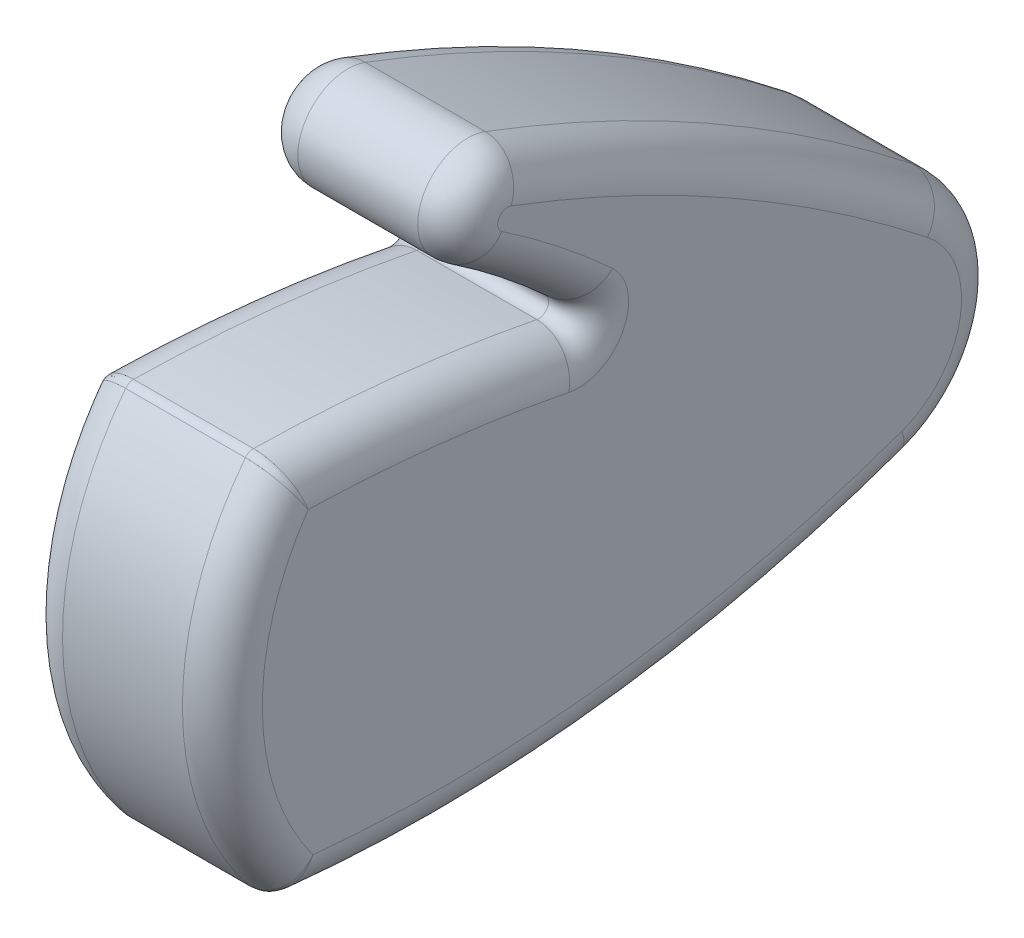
ISO-10303-21;
HEADER;
FILE_DESCRIPTION(('STEP AP214'),'2;1');
FILE_NAME('part.step','',(''),(''),'','','');
FILE_SCHEMA(('AUTOMOTIVE_DESIGN { 1 0 10303 214 1 1 1 1 }'));
ENDSEC;
DATA;
#1=APPLICATION_CONTEXT('core data for automotive mechanical design processes');
#2=APPLICATION_PROTOCOL_DEFINITION('international standard','automotive_design',2000,#1);
#3=PRODUCT_CONTEXT('',#1,'mechanical');
#4=PRODUCT('Part','Part','',(#3));
#5=PRODUCT_RELATED_PRODUCT_CATEGORY('part','',(#4));
#6=PRODUCT_DEFINITION_FORMATION('','',#4);
#7=PRODUCT_DEFINITION_CONTEXT('part definition',#1,'design');
#8=PRODUCT_DEFINITION('design','',#6,#7);
#9=PRODUCT_DEFINITION_SHAPE('','',#8);
#10=(LENGTH_UNIT() NAMED_UNIT(*) SI_UNIT(.MILLI.,.METRE.));
#11=(NAMED_UNIT(*) PLANE_ANGLE_UNIT() SI_UNIT($,.RADIAN.));
#12=(NAMED_UNIT(*) SI_UNIT($,.STERADIAN.) SOLID_ANGLE_UNIT());
#13=UNCERTAINTY_MEASURE_WITH_UNIT(LENGTH_MEASURE(1.E-05),#10,'distance_accuracy_value','');
#14=(GEOMETRIC_REPRESENTATION_CONTEXT(3) GLOBAL_UNCERTAINTY_ASSIGNED_CONTEXT((#13)) GLOBAL_UNIT_ASSIGNED_CONTEXT((#10,
#11,#12)) REPRESENTATION_CONTEXT('',''));
#15=CARTESIAN_POINT('',(0.,0.,0.));
#16=DIRECTION('',(0.,0.,1.));
#17=DIRECTION('',(1.,0.,0.));
#18=AXIS2_PLACEMENT_3D('',#15,#16,#17);
#19=CARTESIAN_POINT('',(228.6,-425.093426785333,466.268037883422));
#20=DIRECTION('',(1.,0.,0.));
#21=DIRECTION('',(0.,0.,-1.));
#22=AXIS2_PLACEMENT_3D('',#19,#20,#21);
#23=CYLINDRICAL_SURFACE('',#22,406.4);
#24=DIRECTION('',(1.,0.,0.));
#25=VECTOR('',#24,1.);
#26=CARTESIAN_POINT('',(228.6,-106.189851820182,214.352437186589));
#27=LINE('',#26,#25);
#28=CARTESIAN_POINT('',(238.76,-106.189851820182,214.352437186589));
#29=VERTEX_POINT('',#28);
#30=CARTESIAN_POINT('',(269.24,-106.189851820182,214.352437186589));
#31=VERTEX_POINT('',#30);
#32=EDGE_CURVE('E172',#29,#31,#27,.T.);
#33=ORIENTED_EDGE('',*,*,#32,.F.);
#34=CARTESIAN_POINT('',(238.76,-425.093426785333,466.268037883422));
#35=DIRECTION('',(1.,0.,0.));
#36=DIRECTION('',(0.,0.,-1.));
#37=AXIS2_PLACEMENT_3D('',#34,#35,#36);
#38=CIRCLE('',#37,406.4);
#39=CARTESIAN_POINT('',(238.76,-44.8220442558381,322.8991583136));
#40=VERTEX_POINT('',#39);
#41=EDGE_CURVE('E168',#29,#40,#38,.T.);
#42=ORIENTED_EDGE('',*,*,#41,.T.);
#43=DIRECTION('',(1.,0.,0.));
#44=VECTOR('',#43,1.);
#45=CARTESIAN_POINT('',(228.6,-44.8220442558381,322.8991583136));
#46=LINE('',#45,#44);
#47=CARTESIAN_POINT('',(269.24,-44.8220442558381,322.8991583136));
#48=VERTEX_POINT('',#47);
#49=EDGE_CURVE('E170',#40,#48,#46,.T.);
#50=ORIENTED_EDGE('',*,*,#49,.T.);
#51=CARTESIAN_POINT('',(269.24,-425.093426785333,466.268037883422));
#52=DIRECTION('',(1.,0.,0.));
#53=DIRECTION('',(0.,0.,-1.));
#54=AXIS2_PLACEMENT_3D('',#51,#52,#53);
#55=CIRCLE('',#54,406.4);
#56=EDGE_CURVE('E178',#48,#31,#55,.F.);
#57=ORIENTED_EDGE('',*,*,#56,.T.);
#58=EDGE_LOOP('',(#33,#42,#50,#57));
#59=FACE_BOUND('',#58,.T.);
#60=ADVANCED_FACE('F35',(#59),#23,.T.);
#61=CARTESIAN_POINT('',(228.6,-132.100767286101,234.820579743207));
#62=DIRECTION('',(1.,0.,0.));
#63=DIRECTION('',(0.,0.,-1.));
#64=AXIS2_PLACEMENT_3D('',#61,#62,#63);
#65=CYLINDRICAL_SURFACE('',#64,33.0199999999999);
#66=DIRECTION('',(1.,0.,0.));
#67=VECTOR('',#66,1.);
#68=CARTESIAN_POINT('',(228.6,-163.206865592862,223.742175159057));
#69=LINE('',#68,#67);
#70=CARTESIAN_POINT('',(238.76,-163.206865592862,223.742175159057));
#71=VERTEX_POINT('',#70);
#72=CARTESIAN_POINT('',(269.24,-163.206865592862,223.742175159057));
#73=VERTEX_POINT('',#72);
#74=EDGE_CURVE('E476',#71,#73,#69,.T.);
#75=ORIENTED_EDGE('',*,*,#74,.F.);
#76=CARTESIAN_POINT('',(238.76,-132.100767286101,234.820579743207));
#77=DIRECTION('',(1.,0.,0.));
#78=DIRECTION('',(0.,0.,-1.));
#79=AXIS2_PLACEMENT_3D('',#76,#77,#78);
#80=CIRCLE('',#79,33.0199999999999);
#81=EDGE_CURVE('E253',#71,#29,#80,.T.);
#82=ORIENTED_EDGE('',*,*,#81,.T.);
#83=ORIENTED_EDGE('',*,*,#32,.T.);
#84=CARTESIAN_POINT('',(269.24,-132.100767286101,234.820579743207));
#85=DIRECTION('',(1.,0.,0.));
#86=DIRECTION('',(0.,0.,-1.));
#87=AXIS2_PLACEMENT_3D('',#84,#85,#86);
#88=CIRCLE('',#87,33.0199999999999);
#89=EDGE_CURVE('E251',#31,#73,#88,.F.);
#90=ORIENTED_EDGE('',*,*,#89,.T.);
#91=EDGE_LOOP('',(#75,#82,#83,#90));
#92=FACE_BOUND('',#91,.T.);
#93=ADVANCED_FACE('F472',(#92),#65,.T.);
#94=CARTESIAN_POINT('',(228.6,171.781885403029,343.048070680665));
#95=DIRECTION('',(1.,0.,0.));
#96=DIRECTION('',(0.,0.,-1.));
#97=AXIS2_PLACEMENT_3D('',#94,#95,#96);
#98=CYLINDRICAL_SURFACE('',#97,355.6);
#99=DIRECTION('',(1.,0.,0.));
#100=VECTOR('',#99,1.);
#101=CARTESIAN_POINT('',(228.6,-181.762239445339,381.23068171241));
#102=LINE('',#101,#100);
#103=CARTESIAN_POINT('',(269.24,-181.762239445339,381.23068171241));
#104=VERTEX_POINT('',#103);
#105=CARTESIAN_POINT('',(238.76,-181.762239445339,381.23068171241));
#106=VERTEX_POINT('',#105);
#107=EDGE_CURVE('E484',#104,#106,#102,.F.);
#108=ORIENTED_EDGE('',*,*,#107,.T.);
#109=CARTESIAN_POINT('',(238.76,171.781885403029,343.048070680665));
#110=DIRECTION('',(1.,0.,0.));
#111=DIRECTION('',(0.,0.,-1.));
#112=AXIS2_PLACEMENT_3D('',#109,#110,#111);
#113=CIRCLE('',#112,355.6);
#114=EDGE_CURVE('E261',#106,#71,#113,.T.);
#115=ORIENTED_EDGE('',*,*,#114,.T.);
#116=ORIENTED_EDGE('',*,*,#74,.T.);
#117=CARTESIAN_POINT('',(269.24,171.781885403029,343.048070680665));
#118=DIRECTION('',(1.,0.,0.));
#119=DIRECTION('',(0.,0.,-1.));
#120=AXIS2_PLACEMENT_3D('',#117,#118,#119);
#121=CIRCLE('',#120,355.6);
#122=EDGE_CURVE('E259',#73,#104,#121,.F.);
#123=ORIENTED_EDGE('',*,*,#122,.T.);
#124=EDGE_LOOP('',(#108,#115,#116,#123));
#125=FACE_BOUND('',#124,.T.);
#126=ADVANCED_FACE('F534',(#125),#98,.T.);
#127=CARTESIAN_POINT('',(228.6,-132.876469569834,323.717195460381));
#128=DIRECTION('',(1.,0.,0.));
#129=DIRECTION('',(0.,0.,-1.));
#130=AXIS2_PLACEMENT_3D('',#127,#128,#129);
#131=CYLINDRICAL_SURFACE('',#130,76.2);
#132=DIRECTION('',(1.,0.,0.));
#133=VECTOR('',#132,1.);
#134=CARTESIAN_POINT('',(228.6,-86.1327345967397,383.89579000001));
#135=LINE('',#134,#133);
#136=CARTESIAN_POINT('',(269.24,-86.1327345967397,383.89579000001));
#137=VERTEX_POINT('',#136);
#138=CARTESIAN_POINT('',(238.76,-86.1327345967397,383.89579000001));
#139=VERTEX_POINT('',#138);
#140=EDGE_CURVE('E475',#137,#139,#135,.F.);
#141=ORIENTED_EDGE('',*,*,#140,.T.);
#142=CARTESIAN_POINT('',(238.76,-132.876469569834,323.717195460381));
#143=DIRECTION('',(1.,0.,0.));
#144=DIRECTION('',(0.,0.,-1.));
#145=AXIS2_PLACEMENT_3D('',#142,#143,#144);
#146=CIRCLE('',#145,76.2);
#147=CARTESIAN_POINT('',(238.76,-180.835560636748,382.931767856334));
#148=VERTEX_POINT('',#147);
#149=EDGE_CURVE('E11',#139,#148,#146,.T.);
#150=ORIENTED_EDGE('',*,*,#149,.T.);
#151=DIRECTION('',(1.,0.,0.));
#152=VECTOR('',#151,1.);
#153=CARTESIAN_POINT('',(228.6,-180.835560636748,382.931767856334));
#154=LINE('',#153,#152);
#155=CARTESIAN_POINT('',(269.24,-180.835560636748,382.931767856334));
#156=VERTEX_POINT('',#155);
#157=EDGE_CURVE('E478',#148,#156,#154,.T.);
#158=ORIENTED_EDGE('',*,*,#157,.T.);
#159=CARTESIAN_POINT('',(269.24,-132.876469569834,323.717195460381));
#160=DIRECTION('',(1.,0.,0.));
#161=DIRECTION('',(0.,0.,-1.));
#162=AXIS2_PLACEMENT_3D('',#159,#160,#161);
#163=CIRCLE('',#162,76.2);
#164=EDGE_CURVE('E49',#156,#137,#163,.F.);
#165=ORIENTED_EDGE('',*,*,#164,.T.);
#166=EDGE_LOOP('',(#141,#150,#158,#165));
#167=FACE_BOUND('',#166,.T.);
#168=ADVANCED_FACE('F538',(#167),#131,.T.);
#169=CARTESIAN_POINT('',(228.6,-491.49826754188,388.407235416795));
#170=DIRECTION('',(1.,0.,0.));
#171=DIRECTION('',(0.,0.,-1.));
#172=AXIS2_PLACEMENT_3D('',#169,#170,#171);
#173=CYLINDRICAL_SURFACE('',#172,406.4);
#174=DIRECTION('',(1.,0.,0.));
#175=VECTOR('',#174,1.);
#176=CARTESIAN_POINT('',(228.6,-92.7687629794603,309.821344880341));
#177=LINE('',#176,#175);
#178=CARTESIAN_POINT('',(269.24,-92.7687629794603,309.821344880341));
#179=VERTEX_POINT('',#178);
#180=CARTESIAN_POINT('',(238.76,-92.7687629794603,309.821344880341));
#181=VERTEX_POINT('',#180);
#182=EDGE_CURVE('E487',#179,#181,#177,.F.);
#183=ORIENTED_EDGE('',*,*,#182,.T.);
#184=CARTESIAN_POINT('',(238.76,-491.49826754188,388.407235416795));
#185=DIRECTION('',(1.,0.,0.));
#186=DIRECTION('',(0.,0.,-1.));
#187=AXIS2_PLACEMENT_3D('',#184,#185,#186);
#188=CIRCLE('',#187,406.4);
#189=CARTESIAN_POINT('',(238.76,-85.1511898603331,381.848846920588));
#190=VERTEX_POINT('',#189);
#191=EDGE_CURVE('E257',#181,#190,#188,.T.);
#192=ORIENTED_EDGE('',*,*,#191,.T.);
#193=DIRECTION('',(1.,0.,0.));
#194=VECTOR('',#193,1.);
#195=CARTESIAN_POINT('',(228.6,-85.1511898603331,381.848846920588));
#196=LINE('',#195,#194);
#197=CARTESIAN_POINT('',(269.24,-85.1511898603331,381.848846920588));
#198=VERTEX_POINT('',#197);
#199=EDGE_CURVE('E490',#190,#198,#196,.T.);
#200=ORIENTED_EDGE('',*,*,#199,.T.);
#201=CARTESIAN_POINT('',(269.24,-491.49826754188,388.407235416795));
#202=DIRECTION('',(1.,0.,0.));
#203=DIRECTION('',(0.,0.,-1.));
#204=AXIS2_PLACEMENT_3D('',#201,#202,#203);
#205=CIRCLE('',#204,406.4);
#206=EDGE_CURVE('E255',#198,#179,#205,.F.);
#207=ORIENTED_EDGE('',*,*,#206,.T.);
#208=EDGE_LOOP('',(#183,#192,#200,#207));
#209=FACE_BOUND('',#208,.T.);
#210=ADVANCED_FACE('F503',(#209),#173,.T.);
#211=CARTESIAN_POINT('',(228.6,-256.873596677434,462.132666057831));
#212=DIRECTION('',(1.,0.,0.));
#213=DIRECTION('',(0.,0.,-1.));
#214=AXIS2_PLACEMENT_3D('',#211,#212,#213);
#215=CYLINDRICAL_SURFACE('',#214,228.6);
#216=DIRECTION('',(1.,0.,0.));
#217=VECTOR('',#216,1.);
#218=CARTESIAN_POINT('',(228.6,-67.2406866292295,334.471711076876));
#219=LINE('',#218,#217);
#220=CARTESIAN_POINT('',(238.76,-67.2406866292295,334.471711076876));
#221=VERTEX_POINT('',#220);
#222=CARTESIAN_POINT('',(269.24,-67.2406866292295,334.471711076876));
#223=VERTEX_POINT('',#222);
#224=EDGE_CURVE('E190',#221,#223,#219,.T.);
#225=ORIENTED_EDGE('',*,*,#224,.F.);
#226=CARTESIAN_POINT('',(238.76,-256.873596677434,462.132666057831));
#227=DIRECTION('',(1.,0.,0.));
#228=DIRECTION('',(0.,0.,-1.));
#229=AXIS2_PLACEMENT_3D('',#226,#227,#228);
#230=CIRCLE('',#229,228.6);
#231=CARTESIAN_POINT('',(238.76,-88.4048283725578,307.613301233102));
#232=VERTEX_POINT('',#231);
#233=EDGE_CURVE('E245',#221,#232,#230,.F.);
#234=ORIENTED_EDGE('',*,*,#233,.T.);
#235=DIRECTION('',(1.,0.,0.));
#236=VECTOR('',#235,1.);
#237=CARTESIAN_POINT('',(228.6,-88.4048283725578,307.613301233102));
#238=LINE('',#237,#236);
#239=CARTESIAN_POINT('',(269.24,-88.4048283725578,307.613301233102));
#240=VERTEX_POINT('',#239);
#241=EDGE_CURVE('E210',#232,#240,#238,.T.);
#242=ORIENTED_EDGE('',*,*,#241,.T.);
#243=CARTESIAN_POINT('',(269.24,-256.873596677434,462.132666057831));
#244=DIRECTION('',(1.,0.,0.));
#245=DIRECTION('',(0.,0.,-1.));
#246=AXIS2_PLACEMENT_3D('',#243,#244,#245);
#247=CIRCLE('',#246,228.6);
#248=EDGE_CURVE('E243',#240,#223,#247,.T.);
#249=ORIENTED_EDGE('',*,*,#248,.T.);
#250=EDGE_LOOP('',(#225,#234,#242,#249));
#251=FACE_BOUND('',#250,.T.);
#252=ADVANCED_FACE('F495',(#251),#215,.F.);
#253=CARTESIAN_POINT('',(228.6,-56.7055249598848,327.379435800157));
#254=DIRECTION('',(1.,0.,0.));
#255=DIRECTION('',(0.,0.,-1.));
#256=AXIS2_PLACEMENT_3D('',#253,#254,#255);
#257=CYLINDRICAL_SURFACE('',#256,12.7);
#258=ORIENTED_EDGE('',*,*,#49,.F.);
#259=CARTESIAN_POINT('',(238.76,-56.7055249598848,327.379435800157));
#260=DIRECTION('',(1.,0.,0.));
#261=DIRECTION('',(0.,0.,-1.));
#262=AXIS2_PLACEMENT_3D('',#259,#260,#261);
#263=CIRCLE('',#262,12.7);
#264=EDGE_CURVE('E186',#40,#221,#263,.T.);
#265=ORIENTED_EDGE('',*,*,#264,.T.);
#266=ORIENTED_EDGE('',*,*,#224,.T.);
#267=CARTESIAN_POINT('',(269.24,-56.7055249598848,327.379435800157));
#268=DIRECTION('',(1.,0.,0.));
#269=DIRECTION('',(0.,0.,-1.));
#270=AXIS2_PLACEMENT_3D('',#267,#268,#269);
#271=CIRCLE('',#270,12.7);
#272=EDGE_CURVE('E189',#223,#48,#271,.F.);
#273=ORIENTED_EDGE('',*,*,#272,.T.);
#274=EDGE_LOOP('',(#258,#265,#266,#273));
#275=FACE_BOUND('',#274,.T.);
#276=ADVANCED_FACE('F183',(#275),#257,.T.);
#277=CARTESIAN_POINT('',(228.6,-240.899475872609,396.823736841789));
#278=DIRECTION('',(1.,0.,0.));
#279=DIRECTION('',(0.,0.,-1.));
#280=AXIS2_PLACEMENT_3D('',#277,#278,#279);
#281=PLANE('',#280);
#282=CARTESIAN_POINT('',(228.6,-256.873596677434,462.132666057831));
#283=DIRECTION('',(1.,0.,0.));
#284=DIRECTION('',(0.,0.,-1.));
#285=AXIS2_PLACEMENT_3D('',#282,#283,#284);
#286=CIRCLE('',#285,238.76);
#287=CARTESIAN_POINT('',(228.6,-80.9173275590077,300.745773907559));
#288=VERTEX_POINT('',#287);
#289=CARTESIAN_POINT('',(228.6,-58.8125572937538,328.7978908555));
#290=VERTEX_POINT('',#289);
#291=EDGE_CURVE('E222',#288,#290,#286,.T.);
#292=ORIENTED_EDGE('',*,*,#291,.T.);
#293=CARTESIAN_POINT('',(228.6,-56.7055249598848,327.379435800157));
#294=DIRECTION('',(1.,0.,0.));
#295=DIRECTION('',(0.,0.,-1.));
#296=AXIS2_PLACEMENT_3D('',#293,#294,#295);
#297=CIRCLE('',#296,2.54000000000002);
#298=CARTESIAN_POINT('',(228.6,-54.3288288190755,326.483380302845));
#299=VERTEX_POINT('',#298);
#300=EDGE_CURVE('E224',#290,#299,#297,.F.);
#301=ORIENTED_EDGE('',*,*,#300,.T.);
#302=CARTESIAN_POINT('',(228.6,-425.093426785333,466.268037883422));
#303=DIRECTION('',(1.,0.,0.));
#304=DIRECTION('',(0.,0.,-1.));
#305=AXIS2_PLACEMENT_3D('',#302,#303,#304);
#306=CIRCLE('',#305,396.24);
#307=CARTESIAN_POINT('',(228.6,-114.162441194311,220.65032720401));
#308=VERTEX_POINT('',#307);
#309=EDGE_CURVE('E196',#299,#308,#306,.F.);
#310=ORIENTED_EDGE('',*,*,#309,.T.);
#311=CARTESIAN_POINT('',(228.6,-132.100767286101,234.820579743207));
#312=DIRECTION('',(1.,0.,0.));
#313=DIRECTION('',(0.,0.,-1.));
#314=AXIS2_PLACEMENT_3D('',#311,#312,#313);
#315=CIRCLE('',#314,22.8599999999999);
#316=CARTESIAN_POINT('',(228.6,-153.635758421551,227.150915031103));
#317=VERTEX_POINT('',#316);
#318=EDGE_CURVE('E217',#308,#317,#315,.F.);
#319=ORIENTED_EDGE('',*,*,#318,.T.);
#320=CARTESIAN_POINT('',(228.6,171.781885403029,343.048070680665));
#321=DIRECTION('',(1.,0.,0.));
#322=DIRECTION('',(0.,0.,-1.));
#323=AXIS2_PLACEMENT_3D('',#320,#321,#322);
#324=CIRCLE('',#323,345.44);
#325=CARTESIAN_POINT('',(228.6,-171.992853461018,376.926124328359));
#326=VERTEX_POINT('',#325);
#327=EDGE_CURVE('E208',#317,#326,#324,.F.);
#328=ORIENTED_EDGE('',*,*,#327,.T.);
#329=CARTESIAN_POINT('',(228.6,-132.876469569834,323.717195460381));
#330=DIRECTION('',(1.,0.,0.));
#331=DIRECTION('',(0.,0.,-1.));
#332=AXIS2_PLACEMENT_3D('',#329,#330,#331);
#333=CIRCLE('',#332,66.04);
#334=CARTESIAN_POINT('',(228.6,-95.3926472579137,378.088554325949));
#335=VERTEX_POINT('',#334);
#336=EDGE_CURVE('E206',#326,#335,#333,.F.);
#337=ORIENTED_EDGE('',*,*,#336,.T.);
#338=CARTESIAN_POINT('',(228.6,-491.49826754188,388.407235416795));
#339=DIRECTION('',(1.,0.,0.));
#340=DIRECTION('',(0.,0.,-1.));
#341=AXIS2_PLACEMENT_3D('',#338,#339,#340);
#342=CIRCLE('',#341,396.24);
#343=CARTESIAN_POINT('',(228.6,-102.737000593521,311.785992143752));
#344=VERTEX_POINT('',#343);
#345=EDGE_CURVE('E215',#335,#344,#342,.F.);
#346=ORIENTED_EDGE('',*,*,#345,.T.);
#347=CARTESIAN_POINT('',(228.6,-90.2767035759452,309.330183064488));
#348=DIRECTION('',(1.,0.,0.));
#349=DIRECTION('',(0.,0.,-1.));
#350=AXIS2_PLACEMENT_3D('',#347,#348,#349);
#351=CIRCLE('',#350,12.7);
#352=EDGE_CURVE('E219',#344,#288,#351,.T.);
#353=ORIENTED_EDGE('',*,*,#352,.T.);
#354=EDGE_LOOP('',(#292,#301,#310,#319,#328,#337,#346,#353));
#355=FACE_BOUND('',#354,.T.);
#356=ADVANCED_FACE('F515',(#355),#281,.F.);
#357=CARTESIAN_POINT('',(279.4,-240.899475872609,396.823736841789));
#358=DIRECTION('',(1.,0.,0.));
#359=DIRECTION('',(0.,0.,-1.));
#360=AXIS2_PLACEMENT_3D('',#357,#358,#359);
#361=PLANE('',#360);
#362=CARTESIAN_POINT('',(279.4,-425.093426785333,466.268037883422));
#363=DIRECTION('',(1.,0.,0.));
#364=DIRECTION('',(0.,0.,-1.));
#365=AXIS2_PLACEMENT_3D('',#362,#363,#364);
#366=CIRCLE('',#365,396.24);
#367=CARTESIAN_POINT('',(279.4,-114.162441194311,220.65032720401));
#368=VERTEX_POINT('',#367);
#369=CARTESIAN_POINT('',(279.4,-54.3288288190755,326.483380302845));
#370=VERTEX_POINT('',#369);
#371=EDGE_CURVE('E236',#368,#370,#366,.T.);
#372=ORIENTED_EDGE('',*,*,#371,.T.);
#373=CARTESIAN_POINT('',(279.4,-56.7055249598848,327.379435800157));
#374=DIRECTION('',(1.,0.,0.));
#375=DIRECTION('',(0.,0.,-1.));
#376=AXIS2_PLACEMENT_3D('',#373,#374,#375);
#377=CIRCLE('',#376,2.54000000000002);
#378=CARTESIAN_POINT('',(279.4,-58.8125572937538,328.7978908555));
#379=VERTEX_POINT('',#378);
#380=EDGE_CURVE('E240',#370,#379,#377,.T.);
#381=ORIENTED_EDGE('',*,*,#380,.T.);
#382=CARTESIAN_POINT('',(279.4,-256.873596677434,462.132666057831));
#383=DIRECTION('',(1.,0.,0.));
#384=DIRECTION('',(0.,0.,-1.));
#385=AXIS2_PLACEMENT_3D('',#382,#383,#384);
#386=CIRCLE('',#385,238.76);
#387=CARTESIAN_POINT('',(279.4,-80.9173275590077,300.745773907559));
#388=VERTEX_POINT('',#387);
#389=EDGE_CURVE('E238',#379,#388,#386,.F.);
#390=ORIENTED_EDGE('',*,*,#389,.T.);
#391=CARTESIAN_POINT('',(279.4,-90.2767035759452,309.330183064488));
#392=DIRECTION('',(1.,0.,0.));
#393=DIRECTION('',(0.,0.,-1.));
#394=AXIS2_PLACEMENT_3D('',#391,#392,#393);
#395=CIRCLE('',#394,12.7);
#396=CARTESIAN_POINT('',(279.4,-102.737000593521,311.785992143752));
#397=VERTEX_POINT('',#396);
#398=EDGE_CURVE('E234',#388,#397,#395,.F.);
#399=ORIENTED_EDGE('',*,*,#398,.T.);
#400=CARTESIAN_POINT('',(279.4,-491.49826754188,388.407235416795));
#401=DIRECTION('',(1.,0.,0.));
#402=DIRECTION('',(0.,0.,-1.));
#403=AXIS2_PLACEMENT_3D('',#400,#401,#402);
#404=CIRCLE('',#403,396.24);
#405=CARTESIAN_POINT('',(279.4,-95.3926472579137,378.088554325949));
#406=VERTEX_POINT('',#405);
#407=EDGE_CURVE('E230',#397,#406,#404,.T.);
#408=ORIENTED_EDGE('',*,*,#407,.T.);
#409=CARTESIAN_POINT('',(279.4,-132.876469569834,323.717195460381));
#410=DIRECTION('',(1.,0.,0.));
#411=DIRECTION('',(0.,0.,-1.));
#412=AXIS2_PLACEMENT_3D('',#409,#410,#411);
#413=CIRCLE('',#412,66.04);
#414=CARTESIAN_POINT('',(279.4,-171.992853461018,376.926124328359));
#415=VERTEX_POINT('',#414);
#416=EDGE_CURVE('E226',#406,#415,#413,.T.);
#417=ORIENTED_EDGE('',*,*,#416,.T.);
#418=CARTESIAN_POINT('',(279.4,171.781885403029,343.048070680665));
#419=DIRECTION('',(1.,0.,0.));
#420=DIRECTION('',(0.,0.,-1.));
#421=AXIS2_PLACEMENT_3D('',#418,#419,#420);
#422=CIRCLE('',#421,345.44);
#423=CARTESIAN_POINT('',(279.4,-153.635758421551,227.150915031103));
#424=VERTEX_POINT('',#423);
#425=EDGE_CURVE('E228',#415,#424,#422,.T.);
#426=ORIENTED_EDGE('',*,*,#425,.T.);
#427=CARTESIAN_POINT('',(279.4,-132.100767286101,234.820579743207));
#428=DIRECTION('',(1.,0.,0.));
#429=DIRECTION('',(0.,0.,-1.));
#430=AXIS2_PLACEMENT_3D('',#427,#428,#429);
#431=CIRCLE('',#430,22.8599999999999);
#432=EDGE_CURVE('E232',#424,#368,#431,.T.);
#433=ORIENTED_EDGE('',*,*,#432,.T.);
#434=EDGE_LOOP('',(#372,#381,#390,#399,#408,#417,#426,#433));
#435=FACE_BOUND('',#434,.T.);
#436=ADVANCED_FACE('F465',(#435),#361,.T.);
#437=CARTESIAN_POINT('',(228.6,-179.23692426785,380.957948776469));
#438=DIRECTION('',(1.,0.,0.));
#439=DIRECTION('',(0.,0.,-1.));
#440=AXIS2_PLACEMENT_3D('',#437,#438,#439);
#441=CYLINDRICAL_SURFACE('',#440,2.54);
#442=ORIENTED_EDGE('',*,*,#157,.F.);
#443=CARTESIAN_POINT('',(238.76,-179.23692426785,380.957948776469));
#444=DIRECTION('',(1.,0.,0.));
#445=DIRECTION('',(0.,0.,-1.));
#446=AXIS2_PLACEMENT_3D('',#443,#444,#445);
#447=CIRCLE('',#446,2.54);
#448=EDGE_CURVE('E268',#148,#106,#447,.T.);
#449=ORIENTED_EDGE('',*,*,#448,.T.);
#450=ORIENTED_EDGE('',*,*,#107,.F.);
#451=CARTESIAN_POINT('',(269.24,-179.23692426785,380.957948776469));
#452=DIRECTION('',(-1.,0.,0.));
#453=DIRECTION('',(0.,0.,1.));
#454=AXIS2_PLACEMENT_3D('',#451,#452,#453);
#455=CIRCLE('',#454,2.54);
#456=EDGE_CURVE('E57',#104,#156,#455,.T.);
#457=ORIENTED_EDGE('',*,*,#456,.T.);
#458=EDGE_LOOP('',(#442,#449,#450,#457));
#459=FACE_BOUND('',#458,.T.);
#460=ADVANCED_FACE('F532',(#459),#441,.T.);
#461=CARTESIAN_POINT('',(228.6,-87.6908590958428,381.88983684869));
#462=DIRECTION('',(1.,0.,0.));
#463=DIRECTION('',(0.,0.,-1.));
#464=AXIS2_PLACEMENT_3D('',#461,#462,#463);
#465=CYLINDRICAL_SURFACE('',#464,2.54);
#466=ORIENTED_EDGE('',*,*,#199,.F.);
#467=CARTESIAN_POINT('',(238.76,-87.6908590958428,381.88983684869));
#468=DIRECTION('',(1.,0.,0.));
#469=DIRECTION('',(0.,0.,-1.));
#470=AXIS2_PLACEMENT_3D('',#467,#468,#469);
#471=CIRCLE('',#470,2.54);
#472=EDGE_CURVE('E265',#190,#139,#471,.T.);
#473=ORIENTED_EDGE('',*,*,#472,.T.);
#474=ORIENTED_EDGE('',*,*,#140,.F.);
#475=CARTESIAN_POINT('',(269.24,-87.6908590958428,381.88983684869));
#476=DIRECTION('',(-1.,0.,0.));
#477=DIRECTION('',(0.,0.,1.));
#478=AXIS2_PLACEMENT_3D('',#475,#476,#477);
#479=CIRCLE('',#478,2.54);
#480=EDGE_CURVE('E263',#137,#198,#479,.T.);
#481=ORIENTED_EDGE('',*,*,#480,.T.);
#482=EDGE_LOOP('',(#466,#473,#474,#481));
#483=FACE_BOUND('',#482,.T.);
#484=ADVANCED_FACE('F522',(#483),#465,.T.);
#485=CARTESIAN_POINT('',(228.6,-90.2767035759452,309.330183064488));
#486=DIRECTION('',(1.,0.,0.));
#487=DIRECTION('',(0.,0.,-1.));
#488=AXIS2_PLACEMENT_3D('',#485,#486,#487);
#489=CYLINDRICAL_SURFACE('',#488,2.54);
#490=ORIENTED_EDGE('',*,*,#241,.F.);
#491=CARTESIAN_POINT('',(238.76,-90.2767035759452,309.330183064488));
#492=DIRECTION('',(1.,0.,0.));
#493=DIRECTION('',(0.,0.,-1.));
#494=AXIS2_PLACEMENT_3D('',#491,#492,#493);
#495=CIRCLE('',#494,2.54);
#496=EDGE_CURVE('E249',#232,#181,#495,.F.);
#497=ORIENTED_EDGE('',*,*,#496,.T.);
#498=ORIENTED_EDGE('',*,*,#182,.F.);
#499=CARTESIAN_POINT('',(269.24,-90.2767035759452,309.330183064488));
#500=DIRECTION('',(1.,0.,0.));
#501=DIRECTION('',(0.,0.,-1.));
#502=AXIS2_PLACEMENT_3D('',#499,#500,#501);
#503=CIRCLE('',#502,2.54);
#504=EDGE_CURVE('E177',#179,#240,#503,.T.);
#505=ORIENTED_EDGE('',*,*,#504,.T.);
#506=EDGE_LOOP('',(#490,#497,#498,#505));
#507=FACE_BOUND('',#506,.T.);
#508=ADVANCED_FACE('F315',(#507),#489,.F.);
#509=CARTESIAN_POINT('',(238.76,-132.876469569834,323.717195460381));
#510=DIRECTION('',(1.,0.,0.));
#511=DIRECTION('',(0.,0.,-1.));
#512=AXIS2_PLACEMENT_3D('',#509,#510,#511);
#513=TOROIDAL_SURFACE('',#512,66.04,10.16);
#514=CARTESIAN_POINT('',(228.6,-171.992853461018,376.926124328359));
#515=CARTESIAN_POINT('',(228.6,-171.992853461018,376.926124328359));
#516=CARTESIAN_POINT('',(228.6,-171.992853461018,376.926124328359));
#517=CARTESIAN_POINT('',(228.599999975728,-172.000762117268,376.929664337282));
#518=CARTESIAN_POINT('',(228.599999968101,-172.000348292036,376.930391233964));
#519=CARTESIAN_POINT('',(228.599999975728,-171.999934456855,376.931118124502));
#520=CARTESIAN_POINT('',(228.600009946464,-172.008671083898,376.933204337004));
#521=CARTESIAN_POINT('',(228.600009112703,-172.007843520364,376.934658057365));
#522=CARTESIAN_POINT('',(228.600009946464,-172.007015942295,376.936111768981));
#523=CARTESIAN_POINT('',(228.601505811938,-172.601229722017,377.198418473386));
#524=CARTESIAN_POINT('',(228.601381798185,-172.569425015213,377.254327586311));
#525=CARTESIAN_POINT('',(228.601505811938,-172.537593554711,377.310221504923));
#526=CARTESIAN_POINT('',(228.657598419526,-173.187450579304,377.459987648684));
#527=CARTESIAN_POINT('',(228.652930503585,-173.126560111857,377.569781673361));
#528=CARTESIAN_POINT('',(228.657598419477,-173.063651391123,377.678432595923));
#529=CARTESIAN_POINT('',(228.879749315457,-174.346274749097,377.975558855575));
#530=CARTESIAN_POINT('',(228.858027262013,-174.230795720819,378.191886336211));
#531=CARTESIAN_POINT('',(228.879749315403,-174.105652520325,378.402767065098));
#532=CARTESIAN_POINT('',(229.046119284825,-174.918834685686,378.229537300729));
#533=CARTESIAN_POINT('',(229.012550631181,-174.779606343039,378.49948040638));
#534=CARTESIAN_POINT('',(229.046119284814,-174.621562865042,378.75885316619));
#535=CARTESIAN_POINT('',(229.376902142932,-175.753439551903,378.598789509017));
#536=CARTESIAN_POINT('',(229.321337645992,-175.583004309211,378.947718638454));
#537=CARTESIAN_POINT('',(229.376902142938,-175.374938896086,379.275601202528));
#538=CARTESIAN_POINT('',(229.500912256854,-176.027938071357,378.72006883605));
#539=CARTESIAN_POINT('',(229.437761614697,-175.84869544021,379.095600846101));
#540=CARTESIAN_POINT('',(229.500912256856,-175.622953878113,379.445159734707));
#541=CARTESIAN_POINT('',(229.775636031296,-176.566497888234,378.957719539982));
#542=CARTESIAN_POINT('',(229.69676999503,-176.372052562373,379.386263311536));
#543=CARTESIAN_POINT('',(229.775636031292,-176.10996561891,379.777117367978));
#544=CARTESIAN_POINT('',(229.926339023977,-176.830563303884,379.074092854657));
#545=CARTESIAN_POINT('',(229.839512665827,-176.629830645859,379.52910362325));
#546=CARTESIAN_POINT('',(229.92633902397,-176.348965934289,379.939519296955));
#547=CARTESIAN_POINT('',(230.253753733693,-177.345841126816,379.300910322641));
#548=CARTESIAN_POINT('',(230.151122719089,-177.135139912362,379.808532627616));
#549=CARTESIAN_POINT('',(230.253753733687,-176.815699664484,380.255779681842));
#550=CARTESIAN_POINT('',(230.43045437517,-177.597058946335,379.411356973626));
#551=CARTESIAN_POINT('',(230.320154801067,-177.382734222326,379.945153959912));
#552=CARTESIAN_POINT('',(230.430454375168,-177.043437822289,380.409641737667));
#553=CARTESIAN_POINT('',(230.808949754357,-178.084266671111,379.625324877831));
#554=CARTESIAN_POINT('',(230.684134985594,-177.865350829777,380.210954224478));
#555=CARTESIAN_POINT('',(230.808949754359,-177.485426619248,380.707481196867));
#556=CARTESIAN_POINT('',(231.010731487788,-178.320264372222,379.728849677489));
#557=CARTESIAN_POINT('',(230.879238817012,-178.10038502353,380.340137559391));
#558=CARTESIAN_POINT('',(231.01073148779,-177.699684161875,380.851463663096));
#559=CARTESIAN_POINT('',(231.426872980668,-178.762591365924,379.922694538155));
#560=CARTESIAN_POINT('',(231.283822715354,-178.543246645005,380.583128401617));
#561=CARTESIAN_POINT('',(231.426872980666,-178.101524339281,381.120865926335));
#562=CARTESIAN_POINT('',(231.639986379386,-178.969831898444,380.013424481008));
#563=CARTESIAN_POINT('',(231.492156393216,-178.751867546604,380.697392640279));
#564=CARTESIAN_POINT('',(231.63998637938,-178.289920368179,381.24686632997));
#565=CARTESIAN_POINT('',(232.086375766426,-179.366460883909,380.186923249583));
#566=CARTESIAN_POINT('',(231.930940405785,-179.153273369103,380.916920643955));
#567=CARTESIAN_POINT('',(232.086375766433,-178.650682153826,381.487658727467));
#568=CARTESIAN_POINT('',(232.319642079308,-179.555857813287,380.269695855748));
#569=CARTESIAN_POINT('',(232.16147310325,-179.345982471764,381.022141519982));
#570=CARTESIAN_POINT('',(232.319642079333,-178.823055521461,381.602456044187));
#571=CARTESIAN_POINT('',(232.804971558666,-179.914940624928,380.426510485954));
#572=CARTESIAN_POINT('',(232.643770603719,-179.713309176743,381.222440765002));
#573=CARTESIAN_POINT('',(232.804971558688,-179.150020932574,381.819819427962));
#574=CARTESIAN_POINT('',(233.057040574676,-180.084620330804,380.500549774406));
#575=CARTESIAN_POINT('',(232.89558998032,-179.887800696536,381.317449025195));
#576=CARTESIAN_POINT('',(233.057040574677,-179.304607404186,381.922381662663));
#577=CARTESIAN_POINT('',(233.57806935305,-180.402248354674,380.639057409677));
#578=CARTESIAN_POINT('',(233.418903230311,-180.216142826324,381.496023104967));
#579=CARTESIAN_POINT('',(233.57806935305,-179.5941019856,382.114153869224));
#580=CARTESIAN_POINT('',(233.847027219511,-180.550199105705,380.703526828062));
#581=CARTESIAN_POINT('',(233.690387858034,-180.369848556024,381.579509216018));
#582=CARTESIAN_POINT('',(233.847027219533,-179.729012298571,382.203365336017));
#583=CARTESIAN_POINT('',(234.376915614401,-180.811354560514,380.817264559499));
#584=CARTESIAN_POINT('',(234.227857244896,-180.642441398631,381.727428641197));
#585=CARTESIAN_POINT('',(234.376915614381,-179.96723127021,382.360688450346));
#586=CARTESIAN_POINT('',(234.636681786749,-180.926417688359,380.867347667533));
#587=CARTESIAN_POINT('',(234.492474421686,-180.763063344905,381.792815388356));
#588=CARTESIAN_POINT('',(234.636681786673,-180.072227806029,382.429932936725));
#589=CARTESIAN_POINT('',(235.166755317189,-181.135498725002,380.958317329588));
#590=CARTESIAN_POINT('',(235.034676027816,-180.983121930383,381.912019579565));
#591=CARTESIAN_POINT('',(235.166755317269,-180.263065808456,382.555667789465));
#592=CARTESIAN_POINT('',(235.43706155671,-181.2295188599,380.999204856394));
#593=CARTESIAN_POINT('',(235.312156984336,-181.082436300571,381.965770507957));
#594=CARTESIAN_POINT('',(235.437061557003,-180.348909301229,382.612159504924));
#595=CARTESIAN_POINT('',(235.985643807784,-181.395306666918,381.071280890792));
#596=CARTESIAN_POINT('',(235.877275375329,-181.258152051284,382.060819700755));
#597=CARTESIAN_POINT('',(235.985643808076,-180.500308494,382.711718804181));
#598=CARTESIAN_POINT('',(236.263904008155,-181.467115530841,381.102487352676));
#599=CARTESIAN_POINT('',(236.164746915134,-181.334483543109,382.102080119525));
#600=CARTESIAN_POINT('',(236.263904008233,-180.565901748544,382.754811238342));
#601=CARTESIAN_POINT('',(236.826530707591,-181.587852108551,381.154945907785));
#602=CARTESIAN_POINT('',(236.747597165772,-181.46316228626,382.171610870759));
#603=CARTESIAN_POINT('',(236.826530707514,-180.676202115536,382.827238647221));
#604=CARTESIAN_POINT('',(237.110894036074,-181.636791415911,381.176203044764));
#605=CARTESIAN_POINT('',(237.042785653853,-181.515431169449,382.199838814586));
#606=CARTESIAN_POINT('',(237.110894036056,-180.720919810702,382.856580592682));
#607=CARTESIAN_POINT('',(237.622796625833,-181.703368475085,381.205118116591));
#608=CARTESIAN_POINT('',(237.575110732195,-181.586654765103,382.238295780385));
#609=CARTESIAN_POINT('',(237.622796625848,-180.781758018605,382.896489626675));
#610=CARTESIAN_POINT('',(237.849617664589,-181.725440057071,381.214702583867));
#611=CARTESIAN_POINT('',(237.811237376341,-181.610293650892,382.251056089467));
#612=CARTESIAN_POINT('',(237.849617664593,-180.801928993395,382.909716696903));
#613=CARTESIAN_POINT('',(238.304288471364,-181.754870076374,381.227482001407));
#614=CARTESIAN_POINT('',(238.284960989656,-181.641837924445,382.268082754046));
#615=CARTESIAN_POINT('',(238.304288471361,-180.828825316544,382.927352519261));
#616=CARTESIAN_POINT('',(238.532137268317,-181.76224030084,381.230682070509));
#617=CARTESIAN_POINT('',(238.522444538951,-181.649740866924,382.272347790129));
#618=CARTESIAN_POINT('',(238.532137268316,-180.835561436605,382.931768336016));
#619=CARTESIAN_POINT('',(239.028565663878,-181.76223843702,381.230681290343));
#620=CARTESIAN_POINT('',(239.039989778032,-181.649739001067,382.272346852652));
#621=CARTESIAN_POINT('',(239.028565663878,-180.835559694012,382.931767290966));
#622=CARTESIAN_POINT('',(239.297150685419,-181.751997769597,381.226234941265));
#623=CARTESIAN_POINT('',(239.319906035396,-181.638758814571,382.2664211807));
#624=CARTESIAN_POINT('',(239.297150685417,-180.826200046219,382.925631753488));
#625=CARTESIAN_POINT('',(239.832487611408,-181.711132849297,381.208489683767));
#626=CARTESIAN_POINT('',(239.877544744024,-181.594968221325,382.242783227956));
#627=CARTESIAN_POINT('',(239.832487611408,-180.788853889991,382.901142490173));
#628=CARTESIAN_POINT('',(240.099238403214,-181.68049716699,381.195185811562));
#629=CARTESIAN_POINT('',(240.155083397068,-181.562174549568,382.225079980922));
#630=CARTESIAN_POINT('',(240.099238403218,-180.760856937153,382.882781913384));
#631=CARTESIAN_POINT('',(240.630487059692,-181.59888559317,381.159737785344));
#632=CARTESIAN_POINT('',(240.707084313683,-181.474936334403,382.177968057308));
#633=CARTESIAN_POINT('',(240.630487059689,-180.686284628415,382.833852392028));
#634=CARTESIAN_POINT('',(240.894960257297,-181.547783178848,381.137538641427));
#635=CARTESIAN_POINT('',(240.981348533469,-181.420413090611,382.148516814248));
#636=CARTESIAN_POINT('',(240.894960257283,-180.639593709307,382.803207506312));
#637=CARTESIAN_POINT('',(241.417920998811,-181.42584332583,381.084550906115));
#638=CARTESIAN_POINT('',(241.522519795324,-181.290588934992,382.078352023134));
#639=CARTESIAN_POINT('',(241.417920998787,-180.528202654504,382.730042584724));
#640=CARTESIAN_POINT('',(241.676411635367,-181.355016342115,381.053766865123));
#641=CARTESIAN_POINT('',(241.789285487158,-181.215377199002,382.037686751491));
#642=CARTESIAN_POINT('',(241.676411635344,-180.463512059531,382.687528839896));
#643=CARTESIAN_POINT('',(241.93104211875,-181.274600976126,381.018803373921));
#644=CARTESIAN_POINT('',(242.051670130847,-181.130124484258,381.991564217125));
#645=CARTESIAN_POINT('',(241.93104211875,-180.390079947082,382.639230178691));
#646=(BOUNDED_SURFACE() B_SPLINE_SURFACE(3,2,((#514,#515,#516),(#517,#518,#519),(#520,#521,
#522),(#523,#524,#525),(#526,#527,#528),(#529,#530,#531),(#532,#533,#534),(#535,#536,#537),
(#538,#539,#540),(#541,#542,#543),(#544,#545,#546),(#547,#548,#549),(#550,#551,#552),(#553,#554,
#555),(#556,#557,#558),(#559,#560,#561),(#562,#563,#564),(#565,#566,#567),(#568,#569,#570),
(#571,#572,#573),(#574,#575,#576),(#577,#578,#579),(#580,#581,#582),(#583,#584,#585),(#586,#587,
#588),(#589,#590,#591),(#592,#593,#594),(#595,#596,#597),(#598,#599,#600),(#601,#602,#603),
(#604,#605,#606),(#607,#608,#609),(#610,#611,#612),(#613,#614,#615),(#616,#617,#618),(#619,#620,
#621),(#622,#623,#624),(#625,#626,#627),(#628,#629,#630),(#631,#632,#633),(#634,#635,#636),
(#637,#638,#639),(#640,#641,#642),(#643,#644,#645)),.UNSPECIFIED.,.F.,.F.,
.F.) B_SPLINE_SURFACE_WITH_KNOTS((4,2,2,2,2,2,2,2,2,2,2,2,2,2,2,2,2,2,2,2,2,4),(3,3),(0.,
0.0202441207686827,1.5166826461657,3.01736874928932,3.76964184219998,4.52161496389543,
5.27326865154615,6.02453422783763,6.73569760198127,7.44652142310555,8.15756731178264,
8.86853352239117,9.52092298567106,10.1732434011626,10.8243467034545,11.4751195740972,
11.9880870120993,12.5006430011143,13.104756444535,13.7092087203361,14.317456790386,
14.9253830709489),(0.,1.),
.UNSPECIFIED.) GEOMETRIC_REPRESENTATION_ITEM() RATIONAL_B_SPLINE_SURFACE(((1.,1.,1.),(1.,
1.00000000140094,1.),(1.,0.999999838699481,1.),(1.,0.999975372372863,1.),(1.,0.999055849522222,
1.),(1.,0.995612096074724,1.),(1.,0.993083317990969,1.),(1.,0.988344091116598,1.),(1.,
0.986603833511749,1.),(1.,0.982863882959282,1.),(1.,0.980864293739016,1.),(1.,0.976669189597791,
1.),(1.,0.974473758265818,1.),(1.,0.969957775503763,1.),(1.,0.967637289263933,1.),(1.,
0.963072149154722,1.),(1.,0.960830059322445,1.),(1.,0.956371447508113,1.),(1.,0.954154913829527,
1.),(1.,0.949816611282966,1.),(1.,0.947694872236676,1.),(1.,0.943618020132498,1.),(1.,
0.941662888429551,1.),(1.,0.938138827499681,1.),(1.,0.936551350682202,1.),(1.,0.933622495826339,
1.),(1.,0.932281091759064,1.),(1.,0.929888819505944,1.),(1.,0.928837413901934,1.),(1.,
0.927056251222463,1.),(1.,0.926326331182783,1.),(1.,0.925329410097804,1.),(1.,0.924997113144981,
1.),(1.,0.924553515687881,1.),(1.,0.924442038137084,1.),(1.,0.92444210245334,1.),(1.,
0.924597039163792,1.),(1.,0.925212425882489,1.),(1.,0.925673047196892,1.),(1.,0.926890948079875,
1.),(1.,0.927650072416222,1.),(1.,0.92944110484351,1.),(1.,0.930472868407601,1.),(1.,
0.931629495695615,1.))) REPRESENTATION_ITEM('') SURFACE());
#647=CARTESIAN_POINT('',(241.93104211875,-180.390079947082,382.639230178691));
#648=CARTESIAN_POINT('',(241.676411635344,-180.463512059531,382.687528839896));
#649=CARTESIAN_POINT('',(241.417920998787,-180.528202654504,382.730042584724));
#650=CARTESIAN_POINT('',(240.894960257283,-180.639593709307,382.803207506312));
#651=CARTESIAN_POINT('',(240.630487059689,-180.686284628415,382.833852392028));
#652=CARTESIAN_POINT('',(240.099238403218,-180.760856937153,382.882781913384));
#653=CARTESIAN_POINT('',(239.832487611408,-180.788853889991,382.901142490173));
#654=CARTESIAN_POINT('',(239.297150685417,-180.826200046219,382.925631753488));
#655=CARTESIAN_POINT('',(239.028565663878,-180.835559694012,382.931767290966));
#656=CARTESIAN_POINT('',(238.532137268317,-180.835561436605,382.931768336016));
#657=CARTESIAN_POINT('',(238.304288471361,-180.828825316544,382.927352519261));
#658=CARTESIAN_POINT('',(237.849617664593,-180.801928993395,382.909716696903));
#659=CARTESIAN_POINT('',(237.622796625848,-180.781758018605,382.896489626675));
#660=CARTESIAN_POINT('',(237.110894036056,-180.720919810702,382.856580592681));
#661=CARTESIAN_POINT('',(236.826530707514,-180.676202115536,382.827238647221));
#662=CARTESIAN_POINT('',(236.263904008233,-180.565901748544,382.754811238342));
#663=CARTESIAN_POINT('',(235.985643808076,-180.500308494,382.711718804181));
#664=CARTESIAN_POINT('',(235.437061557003,-180.348909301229,382.612159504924));
#665=CARTESIAN_POINT('',(235.166755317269,-180.263065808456,382.555667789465));
#666=CARTESIAN_POINT('',(234.636681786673,-180.072227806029,382.429932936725));
#667=CARTESIAN_POINT('',(234.376915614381,-179.96723127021,382.360688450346));
#668=CARTESIAN_POINT('',(233.847027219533,-179.729012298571,382.203365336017));
#669=CARTESIAN_POINT('',(233.57806935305,-179.5941019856,382.114153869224));
#670=CARTESIAN_POINT('',(233.057040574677,-179.304607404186,381.922381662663));
#671=CARTESIAN_POINT('',(232.804971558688,-179.150020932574,381.819819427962));
#672=CARTESIAN_POINT('',(232.319642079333,-178.823055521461,381.602456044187));
#673=CARTESIAN_POINT('',(232.086375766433,-178.650682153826,381.487658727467));
#674=CARTESIAN_POINT('',(231.63998637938,-178.289920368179,381.24686632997));
#675=CARTESIAN_POINT('',(231.426872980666,-178.101524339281,381.120865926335));
#676=CARTESIAN_POINT('',(231.01073148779,-177.699684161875,380.851463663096));
#677=CARTESIAN_POINT('',(230.808949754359,-177.485426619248,380.707481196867));
#678=CARTESIAN_POINT('',(230.430454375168,-177.043437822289,380.409641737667));
#679=CARTESIAN_POINT('',(230.253753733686,-176.815699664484,380.255779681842));
#680=CARTESIAN_POINT('',(229.92633902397,-176.348965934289,379.939519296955));
#681=CARTESIAN_POINT('',(229.775636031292,-176.10996561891,379.777117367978));
#682=CARTESIAN_POINT('',(229.500912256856,-175.622953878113,379.445159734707));
#683=CARTESIAN_POINT('',(229.376902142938,-175.374938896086,379.275601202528));
#684=CARTESIAN_POINT('',(229.046119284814,-174.621562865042,378.75885316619));
#685=CARTESIAN_POINT('',(228.879749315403,-174.105652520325,378.402767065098));
#686=CARTESIAN_POINT('',(228.657598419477,-173.063651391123,377.678432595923));
#687=CARTESIAN_POINT('',(228.601505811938,-172.537593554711,377.310221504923));
#688=CARTESIAN_POINT('',(228.600009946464,-172.007015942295,376.936111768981));
#689=CARTESIAN_POINT('',(228.599999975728,-171.999934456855,376.931118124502));
#690=CARTESIAN_POINT('',(228.6,-171.992853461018,376.926124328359));
#691=B_SPLINE_CURVE_WITH_KNOTS('',3,(#647,#648,#649,#650,#651,#652,#653,#654,#655,#656,#657,
#658,#659,#660,#661,#662,#663,#664,#665,#666,#667,#668,#669,#670,#671,#672,#673,#674,#675,#676,
#677,#678,#679,#680,#681,#682,#683,#684,#685,#686,#687,#688,#689,#690),.UNSPECIFIED.,.F.,.F.,(4,
2,2,2,2,2,2,2,2,2,2,2,2,2,2,2,2,2,2,2,2,4),(0.,0.607926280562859,1.21617435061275,
1.82062662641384,2.42474006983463,2.93729605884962,3.45026349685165,4.10103636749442,
4.75213966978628,5.40446008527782,6.05684954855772,6.76781575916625,7.47886164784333,
8.18968546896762,8.90084884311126,9.65211441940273,10.4037681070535,11.1557412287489,
11.9080143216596,13.4087004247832,14.9051389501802,14.9253830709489),.UNSPECIFIED.);
#692=EDGE_CURVE('E191',#148,#326,#691,.T.);
#693=ORIENTED_EDGE('',*,*,#692,.F.);
#694=ORIENTED_EDGE('',*,*,#149,.F.);
#695=CARTESIAN_POINT('',(228.6,-95.3926472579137,378.088554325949));
#696=CARTESIAN_POINT('',(228.6,-95.3926472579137,378.088554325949));
#697=CARTESIAN_POINT('',(228.6,-95.3926472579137,378.088554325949));
#698=CARTESIAN_POINT('',(228.599999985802,-95.3859230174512,378.09297101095));
#699=CARTESIAN_POINT('',(228.599999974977,-95.3855204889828,378.092179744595));
#700=CARTESIAN_POINT('',(228.599999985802,-95.3851179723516,378.091388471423));
#701=CARTESIAN_POINT('',(228.600008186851,-95.3791983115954,378.097387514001));
#702=CARTESIAN_POINT('',(228.600007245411,-95.3783933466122,378.095805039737));
#703=CARTESIAN_POINT('',(228.600008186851,-95.3775883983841,378.094222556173));
#704=CARTESIAN_POINT('',(228.601402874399,-94.8078843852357,378.47256101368));
#705=CARTESIAN_POINT('',(228.601244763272,-94.7728811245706,378.403778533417));
#706=CARTESIAN_POINT('',(228.601402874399,-94.7379146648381,378.334977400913));
#707=CARTESIAN_POINT('',(228.66068919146,-94.2401222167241,378.841969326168));
#708=CARTESIAN_POINT('',(228.653965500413,-94.1704143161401,378.707993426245));
#709=CARTESIAN_POINT('',(228.660689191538,-94.1038555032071,378.572427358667));
#710=CARTESIAN_POINT('',(228.896728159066,-93.1145414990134,379.567964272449));
#711=CARTESIAN_POINT('',(228.865148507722,-92.974926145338,379.30754790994));
#712=CARTESIAN_POINT('',(228.896728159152,-92.8498142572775,379.03985469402));
#713=CARTESIAN_POINT('',(229.073818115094,-92.5567562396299,379.924510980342));
#714=CARTESIAN_POINT('',(229.02495252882,-92.3791581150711,379.604231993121));
#715=CARTESIAN_POINT('',(229.07381811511,-92.2298778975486,379.269808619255));
#716=CARTESIAN_POINT('',(229.427556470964,-91.7416245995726,380.441448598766));
#717=CARTESIAN_POINT('',(229.346315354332,-91.5054418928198,380.036626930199));
#718=CARTESIAN_POINT('',(229.427556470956,-91.325808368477,379.603731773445));
#719=CARTESIAN_POINT('',(229.560497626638,-91.4730044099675,380.611092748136));
#720=CARTESIAN_POINT('',(229.46807668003,-91.2155849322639,380.179604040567));
#721=CARTESIAN_POINT('',(229.560497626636,-91.0282049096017,379.713407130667));
#722=CARTESIAN_POINT('',(229.855607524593,-90.9456517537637,380.942875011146));
#723=CARTESIAN_POINT('',(229.739982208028,-90.6439148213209,380.460746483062));
#724=CARTESIAN_POINT('',(229.855607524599,-90.4445272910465,379.928071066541));
#725=CARTESIAN_POINT('',(230.017763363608,-90.6869149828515,381.105016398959));
#726=CARTESIAN_POINT('',(229.890383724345,-90.3619133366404,380.598999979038));
#727=CARTESIAN_POINT('',(230.017763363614,-90.1584481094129,380.033061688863));
#728=CARTESIAN_POINT('',(230.370774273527,-90.1820249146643,381.420290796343));
#729=CARTESIAN_POINT('',(230.220066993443,-89.8085198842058,380.869542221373));
#730=CARTESIAN_POINT('',(230.370774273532,-89.6007101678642,380.237360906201));
#731=CARTESIAN_POINT('',(230.561615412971,-89.9358655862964,381.573428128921));
#732=CARTESIAN_POINT('',(230.39962183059,-89.5370196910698,381.001879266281));
#733=CARTESIAN_POINT('',(230.561615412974,-89.3290444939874,380.336672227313));
#734=CARTESIAN_POINT('',(230.971204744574,-89.4588819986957,381.869191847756));
#735=CARTESIAN_POINT('',(230.787965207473,-89.0074708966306,381.25932490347));
#736=CARTESIAN_POINT('',(230.971204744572,-88.8030723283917,380.528611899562));
#737=CARTESIAN_POINT('',(231.189936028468,-89.2280485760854,382.011824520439));
#738=CARTESIAN_POINT('',(230.99701752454,-88.7494024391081,381.384438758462));
#739=CARTESIAN_POINT('',(231.189936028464,-88.5487554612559,380.621244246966));
#740=CARTESIAN_POINT('',(231.635306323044,-88.8025802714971,382.273942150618));
#741=CARTESIAN_POINT('',(231.426123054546,-88.2703852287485,381.61612039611));
#742=CARTESIAN_POINT('',(231.635306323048,-88.0803501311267,380.79158515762));
#743=CARTESIAN_POINT('',(231.859844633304,-88.6065285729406,382.394366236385));
#744=CARTESIAN_POINT('',(231.64420281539,-88.0480664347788,381.723393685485));
#745=CARTESIAN_POINT('',(231.859844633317,-87.8646723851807,380.869894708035));
#746=CARTESIAN_POINT('',(232.330267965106,-88.2320783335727,382.623805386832));
#747=CARTESIAN_POINT('',(232.104776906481,-87.6203967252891,381.92934704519));
#748=CARTESIAN_POINT('',(232.330267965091,-87.4529873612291,381.019175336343));
#749=CARTESIAN_POINT('',(232.576141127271,-88.0536701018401,382.732826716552));
#750=CARTESIAN_POINT('',(232.347400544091,-87.4151728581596,382.02796330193));
#751=CARTESIAN_POINT('',(232.576141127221,-87.2569692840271,381.090150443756));
#752=CARTESIAN_POINT('',(233.087795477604,-87.7166860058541,382.93830536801));
#753=CARTESIAN_POINT('',(232.856412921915,-87.0246834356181,382.215280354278));
#754=CARTESIAN_POINT('',(233.087795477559,-86.8869186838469,381.223985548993));
#755=CARTESIAN_POINT('',(233.353578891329,-87.5581123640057,383.034761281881));
#756=CARTESIAN_POINT('',(233.122873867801,-86.8396201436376,382.303881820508));
#757=CARTESIAN_POINT('',(233.353578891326,-86.7128886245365,381.286844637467));
#758=CARTESIAN_POINT('',(233.903025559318,-87.2630942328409,383.213882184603));
#759=CARTESIAN_POINT('',(233.67810541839,-86.4928251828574,382.469669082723));
#760=CARTESIAN_POINT('',(233.903025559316,-86.3892591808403,381.40362381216));
#761=CARTESIAN_POINT('',(234.186685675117,-87.1266458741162,383.296549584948));
#762=CARTESIAN_POINT('',(233.966847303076,-86.3313368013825,382.546736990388));
#763=CARTESIAN_POINT('',(234.186685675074,-86.2396555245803,381.45754546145));
#764=CARTESIAN_POINT('',(234.734870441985,-86.8927298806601,383.438054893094));
#765=CARTESIAN_POINT('',(234.528802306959,-86.0527107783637,382.679546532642));
#766=CARTESIAN_POINT('',(234.734870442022,-85.9832799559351,381.54987695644));
#767=CARTESIAN_POINT('',(234.997673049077,-86.7925581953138,383.498556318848));
#768=CARTESIAN_POINT('',(234.799855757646,-85.9327032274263,382.736676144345));
#769=CARTESIAN_POINT('',(234.997673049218,-85.8735322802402,381.589368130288));
#770=CARTESIAN_POINT('',(235.533338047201,-86.6123168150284,383.6073021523));
#771=CARTESIAN_POINT('',(235.355525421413,-85.7156280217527,382.839926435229));
#772=CARTESIAN_POINT('',(235.533338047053,-85.6761109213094,381.660367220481));
#773=CARTESIAN_POINT('',(235.806198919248,-86.5322440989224,383.65554840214));
#774=CARTESIAN_POINT('',(235.63997335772,-85.6187403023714,382.88596113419));
#775=CARTESIAN_POINT('',(235.806198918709,-85.5884339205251,381.691876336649));
#776=CARTESIAN_POINT('',(236.359177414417,-86.3934384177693,383.739117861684));
#777=CARTESIAN_POINT('',(236.219199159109,-85.450047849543,382.966062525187));
#778=CARTESIAN_POINT('',(236.359177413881,-85.4364744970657,381.746464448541));
#779=CARTESIAN_POINT('',(236.639277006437,-86.3346570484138,383.774470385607));
#780=CARTESIAN_POINT('',(236.513719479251,-85.3783472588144,383.000079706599));
#781=CARTESIAN_POINT('',(236.639277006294,-85.3721390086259,381.769562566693));
#782=CARTESIAN_POINT('',(237.204834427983,-86.23903785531,383.831950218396));
#783=CARTESIAN_POINT('',(237.110536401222,-85.2613296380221,383.055575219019));
#784=CARTESIAN_POINT('',(237.204834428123,-85.2674970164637,381.807122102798));
#785=CARTESIAN_POINT('',(237.490288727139,-86.2021860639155,383.854085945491));
#786=CARTESIAN_POINT('',(237.412536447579,-85.2161185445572,383.077003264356));
#787=CARTESIAN_POINT('',(237.490288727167,-85.227175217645,381.821589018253));
#788=CARTESIAN_POINT('',(237.940402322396,-86.1619580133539,383.878244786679));
#789=CARTESIAN_POINT('',(237.889675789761,-85.1666807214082,383.100430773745));
#790=CARTESIAN_POINT('',(237.94040232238,-85.1831613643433,381.83737889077));
#791=CARTESIAN_POINT('',(238.10411101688,-86.1509996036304,383.884824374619));
#792=CARTESIAN_POINT('',(238.063396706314,-85.1531992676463,383.106818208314));
#793=CARTESIAN_POINT('',(238.104111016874,-85.1711723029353,381.841679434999));
#794=CARTESIAN_POINT('',(238.431873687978,-86.136390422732,383.893595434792));
#795=CARTESIAN_POINT('',(238.411436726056,-85.1352160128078,383.115338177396));
#796=CARTESIAN_POINT('',(238.431873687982,-85.1551893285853,381.847412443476));
#797=CARTESIAN_POINT('',(238.595927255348,-86.1327334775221,383.895790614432));
#798=CARTESIAN_POINT('',(238.585692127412,-85.1307131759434,383.11747120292));
#799=CARTESIAN_POINT('',(238.59592725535,-85.1511886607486,381.848847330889));
#800=CARTESIAN_POINT('',(239.022142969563,-86.1327363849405,383.895789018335));
#801=CARTESIAN_POINT('',(239.038495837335,-85.1307164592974,383.11746976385));
#802=CARTESIAN_POINT('',(239.02214296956,-85.1511917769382,381.848846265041));
#803=CARTESIAN_POINT('',(239.284334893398,-86.142076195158,383.89018278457));
#804=CARTESIAN_POINT('',(239.316913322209,-85.1422145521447,383.112023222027));
#805=CARTESIAN_POINT('',(239.284334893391,-85.1614093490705,381.845181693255));
#806=CARTESIAN_POINT('',(239.806912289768,-86.1793342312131,383.867810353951));
#807=CARTESIAN_POINT('',(239.871404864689,-85.188045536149,383.09030708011));
#808=CARTESIAN_POINT('',(239.806912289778,-85.2021724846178,381.83055897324));
#809=CARTESIAN_POINT('',(240.067296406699,-86.2072651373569,383.851036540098));
#810=CARTESIAN_POINT('',(240.147223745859,-85.2223516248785,383.074050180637));
#811=CARTESIAN_POINT('',(240.067296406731,-85.2327319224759,381.819595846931));
#812=CARTESIAN_POINT('',(240.586104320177,-86.2816635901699,383.806330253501));
#813=CARTESIAN_POINT('',(240.695709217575,-85.3135546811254,383.030810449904));
#814=CARTESIAN_POINT('',(240.586104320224,-85.3141433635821,381.790380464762));
#815=CARTESIAN_POINT('',(240.844499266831,-86.3282670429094,383.778315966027));
#816=CARTESIAN_POINT('',(240.968105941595,-85.3705357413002,383.003787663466));
#817=CARTESIAN_POINT('',(240.844499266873,-85.3651441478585,381.772074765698));
#818=CARTESIAN_POINT('',(241.355336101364,-86.4393708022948,383.711469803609));
#819=CARTESIAN_POINT('',(241.504954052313,-85.5059814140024,382.939507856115));
#820=CARTESIAN_POINT('',(241.355336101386,-85.4867569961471,381.728403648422));
#821=CARTESIAN_POINT('',(241.6077818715,-86.5038590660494,383.67264520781));
#822=CARTESIAN_POINT('',(241.769212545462,-85.5843186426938,382.902311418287));
#823=CARTESIAN_POINT('',(241.607781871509,-85.5573558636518,381.703042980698));
#824=CARTESIAN_POINT('',(241.856419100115,-86.5770032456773,383.628566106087));
#825=CARTESIAN_POINT('',(242.028891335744,-85.6729725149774,382.860183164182));
#826=CARTESIAN_POINT('',(241.856419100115,-85.6374496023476,381.674256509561));
#827=(BOUNDED_SURFACE() B_SPLINE_SURFACE(3,2,((#695,#696,#697),(#698,#699,#700),(#701,#702,
#703),(#704,#705,#706),(#707,#708,#709),(#710,#711,#712),(#713,#714,#715),(#716,#717,#718),
(#719,#720,#721),(#722,#723,#724),(#725,#726,#727),(#728,#729,#730),(#731,#732,#733),(#734,#735,
#736),(#737,#738,#739),(#740,#741,#742),(#743,#744,#745),(#746,#747,#748),(#749,#750,#751),
(#752,#753,#754),(#755,#756,#757),(#758,#759,#760),(#761,#762,#763),(#764,#765,#766),(#767,#768,
#769),(#770,#771,#772),(#773,#774,#775),(#776,#777,#778),(#779,#780,#781),(#782,#783,#784),
(#785,#786,#787),(#788,#789,#790),(#791,#792,#793),(#794,#795,#796),(#797,#798,#799),(#800,#801,
#802),(#803,#804,#805),(#806,#807,#808),(#809,#810,#811),(#812,#813,#814),(#815,#816,#817),
(#818,#819,#820),(#821,#822,#823),(#824,#825,#826)),.UNSPECIFIED.,.F.,.F.,
.F.) B_SPLINE_SURFACE_WITH_KNOTS((4,2,2,2,2,2,2,2,2,2,2,2,2,2,2,2,2,2,2,2,2,4),(3,3),(0.,
0.0190736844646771,1.62034328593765,3.22621762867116,4.03229242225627,4.8380120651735,
5.64334165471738,6.4481853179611,7.18737229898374,7.92615098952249,8.66501238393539,
9.40374442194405,10.0548389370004,10.7058355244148,11.3553426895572,12.0044357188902,
12.3738371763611,12.7429261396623,13.3326284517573,13.92273339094,14.517213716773,
15.1112947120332),(0.,1.),
.UNSPECIFIED.) GEOMETRIC_REPRESENTATION_ITEM() RATIONAL_B_SPLINE_SURFACE(((1.,1.,1.),(1.,
1.00000000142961,1.),(1.,0.99999981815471,1.),(1.,0.999968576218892,1.),(1.,0.998637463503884,
1.),(1.,0.993626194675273,1.),(1.,0.989939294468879,1.),(1.,0.983001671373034,1.),(1.,
0.980448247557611,1.),(1.,0.974953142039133,1.),(1.,0.972011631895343,1.),(1.,0.965835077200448,
1.),(1.,0.962600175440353,1.),(1.,0.955946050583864,1.),(1.,0.952526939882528,1.),(1.,
0.94590691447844,1.),(1.,0.942710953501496,1.),(1.,0.93637059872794,1.),(1.,0.933226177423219,
1.),(1.,0.927096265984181,1.),(1.,0.9241107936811,1.),(1.,0.918411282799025,1.),(1.,
0.91569719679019,1.),(1.,0.910948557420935,1.),(1.,0.908871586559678,1.),(1.,0.905081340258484,
1.),(1.,0.903368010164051,1.),(1.,0.900367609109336,1.),(1.,0.899079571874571,1.),(1.,
0.896971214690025,1.),(1.,0.89615059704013,1.),(1.,0.895252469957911,1.),(1.,0.895007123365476,
1.),(1.,0.89467980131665,1.),(1.,0.894597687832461,1.),(1.,0.894597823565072,1.),(1.,
0.89480765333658,1.),(1.,0.895640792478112,1.),(1.,0.896264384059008,1.),(1.,0.897912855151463,
1.),(1.,0.89894067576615,1.),(1.,0.901363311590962,1.),(1.,0.902757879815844,1.),(1.,
0.904319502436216,1.))) REPRESENTATION_ITEM('') SURFACE());
#828=CARTESIAN_POINT('',(241.856419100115,-86.5770032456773,383.628566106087));
#829=CARTESIAN_POINT('',(241.6077818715,-86.5038590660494,383.67264520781));
#830=CARTESIAN_POINT('',(241.355336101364,-86.4393708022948,383.711469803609));
#831=CARTESIAN_POINT('',(240.844499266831,-86.3282670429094,383.778315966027));
#832=CARTESIAN_POINT('',(240.586104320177,-86.2816635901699,383.806330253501));
#833=CARTESIAN_POINT('',(240.067296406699,-86.2072651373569,383.851036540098));
#834=CARTESIAN_POINT('',(239.806912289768,-86.1793342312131,383.867810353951));
#835=CARTESIAN_POINT('',(239.284334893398,-86.142076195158,383.89018278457));
#836=CARTESIAN_POINT('',(239.022142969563,-86.1327363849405,383.895789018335));
#837=CARTESIAN_POINT('',(238.595927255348,-86.1327334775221,383.895790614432));
#838=CARTESIAN_POINT('',(238.431873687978,-86.136390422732,383.893595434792));
#839=CARTESIAN_POINT('',(238.10411101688,-86.1509996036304,383.884824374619));
#840=CARTESIAN_POINT('',(237.940402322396,-86.1619580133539,383.878244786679));
#841=CARTESIAN_POINT('',(237.490288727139,-86.2021860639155,383.854085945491));
#842=CARTESIAN_POINT('',(237.204834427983,-86.23903785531,383.831950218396));
#843=CARTESIAN_POINT('',(236.639277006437,-86.3346570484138,383.774470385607));
#844=CARTESIAN_POINT('',(236.359177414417,-86.3934384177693,383.739117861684));
#845=CARTESIAN_POINT('',(235.806198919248,-86.5322440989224,383.65554840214));
#846=CARTESIAN_POINT('',(235.533338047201,-86.6123168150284,383.6073021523));
#847=CARTESIAN_POINT('',(234.997673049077,-86.7925581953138,383.498556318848));
#848=CARTESIAN_POINT('',(234.734870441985,-86.8927298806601,383.438054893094));
#849=CARTESIAN_POINT('',(234.186685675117,-87.1266458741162,383.296549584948));
#850=CARTESIAN_POINT('',(233.903025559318,-87.2630942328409,383.213882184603));
#851=CARTESIAN_POINT('',(233.353578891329,-87.5581123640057,383.034761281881));
#852=CARTESIAN_POINT('',(233.087795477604,-87.7166860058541,382.93830536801));
#853=CARTESIAN_POINT('',(232.576141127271,-88.0536701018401,382.732826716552));
#854=CARTESIAN_POINT('',(232.330267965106,-88.2320783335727,382.623805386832));
#855=CARTESIAN_POINT('',(231.859844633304,-88.6065285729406,382.394366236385));
#856=CARTESIAN_POINT('',(231.635306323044,-88.8025802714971,382.273942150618));
#857=CARTESIAN_POINT('',(231.189936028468,-89.2280485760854,382.011824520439));
#858=CARTESIAN_POINT('',(230.971204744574,-89.4588819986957,381.869191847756));
#859=CARTESIAN_POINT('',(230.561615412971,-89.9358655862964,381.573428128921));
#860=CARTESIAN_POINT('',(230.370774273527,-90.1820249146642,381.420290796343));
#861=CARTESIAN_POINT('',(230.017763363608,-90.6869149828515,381.105016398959));
#862=CARTESIAN_POINT('',(229.855607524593,-90.9456517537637,380.942875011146));
#863=CARTESIAN_POINT('',(229.560497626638,-91.4730044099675,380.611092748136));
#864=CARTESIAN_POINT('',(229.427556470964,-91.7416245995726,380.441448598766));
#865=CARTESIAN_POINT('',(229.073818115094,-92.5567562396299,379.924510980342));
#866=CARTESIAN_POINT('',(228.896728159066,-93.1145414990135,379.567964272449));
#867=CARTESIAN_POINT('',(228.66068919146,-94.240122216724,378.841969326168));
#868=CARTESIAN_POINT('',(228.601402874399,-94.8078843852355,378.472561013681));
#869=CARTESIAN_POINT('',(228.600008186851,-95.3791983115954,378.097387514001));
#870=CARTESIAN_POINT('',(228.599999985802,-95.3859230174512,378.09297101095));
#871=CARTESIAN_POINT('',(228.6,-95.3926472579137,378.088554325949));
#872=B_SPLINE_CURVE_WITH_KNOTS('',3,(#828,#829,#830,#831,#832,#833,#834,#835,#836,#837,#838,
#839,#840,#841,#842,#843,#844,#845,#846,#847,#848,#849,#850,#851,#852,#853,#854,#855,#856,#857,
#858,#859,#860,#861,#862,#863,#864,#865,#866,#867,#868,#869,#870,#871),.UNSPECIFIED.,.F.,.F.,(4,
2,2,2,2,2,2,2,2,2,2,2,2,2,2,2,2,2,2,2,2,4),(0.,0.594080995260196,1.18856132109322,
1.77866626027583,2.36836857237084,2.73745753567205,3.10685899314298,3.75595202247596,
4.40545918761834,5.0564557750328,5.70755029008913,6.44628232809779,7.18514372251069,
7.92392241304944,8.66310939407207,9.46795305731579,10.2732826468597,11.0790022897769,
11.885077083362,13.4909514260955,15.0922210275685,15.1112947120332),.UNSPECIFIED.);
#873=EDGE_CURVE('E329',#335,#139,#872,.F.);
#874=ORIENTED_EDGE('',*,*,#873,.F.);
#875=ORIENTED_EDGE('',*,*,#336,.F.);
#876=EDGE_LOOP('',(#693,#694,#874,#875));
#877=FACE_BOUND('',#876,.T.);
#878=ADVANCED_FACE('F310',(#877),#513,.T.);
#879=ORIENTED_EDGE('',*,*,#448,.F.);
#880=ORIENTED_EDGE('',*,*,#692,.T.);
#881=CARTESIAN_POINT('',(241.93104211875,-181.274600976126,381.018803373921));
#882=CARTESIAN_POINT('',(241.676411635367,-181.355016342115,381.053766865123));
#883=CARTESIAN_POINT('',(241.417920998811,-181.42584332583,381.084550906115));
#884=CARTESIAN_POINT('',(240.894960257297,-181.547783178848,381.137538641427));
#885=CARTESIAN_POINT('',(240.630487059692,-181.59888559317,381.159737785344));
#886=CARTESIAN_POINT('',(240.099238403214,-181.68049716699,381.195185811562));
#887=CARTESIAN_POINT('',(239.832487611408,-181.711132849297,381.208489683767));
#888=CARTESIAN_POINT('',(239.297150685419,-181.751997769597,381.226234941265));
#889=CARTESIAN_POINT('',(239.028565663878,-181.76223843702,381.230681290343));
#890=CARTESIAN_POINT('',(238.532137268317,-181.76224030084,381.230682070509));
#891=CARTESIAN_POINT('',(238.304288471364,-181.754870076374,381.227482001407));
#892=CARTESIAN_POINT('',(237.849617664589,-181.725440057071,381.214702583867));
#893=CARTESIAN_POINT('',(237.622796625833,-181.703368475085,381.205118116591));
#894=CARTESIAN_POINT('',(237.110894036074,-181.636791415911,381.176203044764));
#895=CARTESIAN_POINT('',(236.826530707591,-181.587852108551,381.154945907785));
#896=CARTESIAN_POINT('',(236.263904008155,-181.467115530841,381.102487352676));
#897=CARTESIAN_POINT('',(235.985643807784,-181.395306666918,381.071280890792));
#898=CARTESIAN_POINT('',(235.43706155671,-181.2295188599,380.999204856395));
#899=CARTESIAN_POINT('',(235.166755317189,-181.135498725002,380.958317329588));
#900=CARTESIAN_POINT('',(234.636681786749,-180.926417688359,380.867347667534));
#901=CARTESIAN_POINT('',(234.376915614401,-180.811354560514,380.817264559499));
#902=CARTESIAN_POINT('',(233.847027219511,-180.550199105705,380.703526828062));
#903=CARTESIAN_POINT('',(233.57806935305,-180.402248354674,380.639057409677));
#904=CARTESIAN_POINT('',(233.057040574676,-180.084620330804,380.500549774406));
#905=CARTESIAN_POINT('',(232.804971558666,-179.914940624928,380.426510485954));
#906=CARTESIAN_POINT('',(232.319642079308,-179.555857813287,380.269695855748));
#907=CARTESIAN_POINT('',(232.086375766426,-179.366460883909,380.186923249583));
#908=CARTESIAN_POINT('',(231.639986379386,-178.969831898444,380.013424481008));
#909=CARTESIAN_POINT('',(231.426872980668,-178.762591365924,379.922694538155));
#910=CARTESIAN_POINT('',(231.010731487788,-178.320264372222,379.728849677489));
#911=CARTESIAN_POINT('',(230.808949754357,-178.084266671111,379.625324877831));
#912=CARTESIAN_POINT('',(230.43045437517,-177.597058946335,379.411356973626));
#913=CARTESIAN_POINT('',(230.253753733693,-177.345841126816,379.300910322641));
#914=CARTESIAN_POINT('',(229.926339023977,-176.830563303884,379.074092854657));
#915=CARTESIAN_POINT('',(229.775636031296,-176.566497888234,378.957719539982));
#916=CARTESIAN_POINT('',(229.500912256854,-176.027938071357,378.72006883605));
#917=CARTESIAN_POINT('',(229.376902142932,-175.753439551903,378.598789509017));
#918=CARTESIAN_POINT('',(229.046119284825,-174.918834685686,378.229537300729));
#919=CARTESIAN_POINT('',(228.879749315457,-174.346274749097,377.975558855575));
#920=CARTESIAN_POINT('',(228.657598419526,-173.187450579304,377.459987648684));
#921=CARTESIAN_POINT('',(228.601505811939,-172.601229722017,377.198418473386));
#922=CARTESIAN_POINT('',(228.600009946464,-172.008671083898,376.933204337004));
#923=CARTESIAN_POINT('',(228.599999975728,-172.000762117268,376.929664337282));
#924=CARTESIAN_POINT('',(228.6,-171.992853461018,376.926124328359));
#925=B_SPLINE_CURVE_WITH_KNOTS('',3,(#881,#882,#883,#884,#885,#886,#887,#888,#889,#890,#891,
#892,#893,#894,#895,#896,#897,#898,#899,#900,#901,#902,#903,#904,#905,#906,#907,#908,#909,#910,
#911,#912,#913,#914,#915,#916,#917,#918,#919,#920,#921,#922,#923,#924),.UNSPECIFIED.,.F.,.F.,(4,
2,2,2,2,2,2,2,2,2,2,2,2,2,2,2,2,2,2,2,2,4),(0.,0.607926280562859,1.21617435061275,
1.82062662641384,2.42474006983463,2.93729605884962,3.45026349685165,4.10103636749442,
4.75213966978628,5.40446008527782,6.05684954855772,6.76781575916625,7.47886164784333,
8.18968546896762,8.90084884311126,9.65211441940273,10.4037681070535,11.1557412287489,
11.9080143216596,13.4087004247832,14.9051389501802,14.9253830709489),.UNSPECIFIED.);
#926=EDGE_CURVE('E290',#106,#326,#925,.T.);
#927=ORIENTED_EDGE('',*,*,#926,.F.);
#928=EDGE_LOOP('',(#879,#880,#927));
#929=FACE_BOUND('',#928,.T.);
#930=ADVANCED_FACE('F314',(#929),#646,.T.);
#931=ORIENTED_EDGE('',*,*,#873,.T.);
#932=ORIENTED_EDGE('',*,*,#472,.F.);
#933=CARTESIAN_POINT('',(241.856419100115,-85.6374496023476,381.674256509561));
#934=CARTESIAN_POINT('',(241.607781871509,-85.5573558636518,381.703042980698));
#935=CARTESIAN_POINT('',(241.355336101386,-85.4867569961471,381.728403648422));
#936=CARTESIAN_POINT('',(240.844499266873,-85.3651441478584,381.772074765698));
#937=CARTESIAN_POINT('',(240.586104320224,-85.3141433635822,381.790380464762));
#938=CARTESIAN_POINT('',(240.067296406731,-85.2327319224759,381.819595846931));
#939=CARTESIAN_POINT('',(239.806912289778,-85.2021724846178,381.83055897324));
#940=CARTESIAN_POINT('',(239.284334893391,-85.1614093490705,381.845181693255));
#941=CARTESIAN_POINT('',(239.02214296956,-85.1511917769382,381.848846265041));
#942=CARTESIAN_POINT('',(238.59592725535,-85.1511886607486,381.848847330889));
#943=CARTESIAN_POINT('',(238.431873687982,-85.1551893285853,381.847412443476));
#944=CARTESIAN_POINT('',(238.104111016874,-85.1711723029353,381.841679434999));
#945=CARTESIAN_POINT('',(237.94040232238,-85.1831613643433,381.83737889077));
#946=CARTESIAN_POINT('',(237.490288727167,-85.2271752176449,381.821589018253));
#947=CARTESIAN_POINT('',(237.204834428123,-85.2674970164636,381.807122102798));
#948=CARTESIAN_POINT('',(236.639277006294,-85.3721390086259,381.769562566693));
#949=CARTESIAN_POINT('',(236.359177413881,-85.4364744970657,381.746464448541));
#950=CARTESIAN_POINT('',(235.806198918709,-85.5884339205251,381.691876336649));
#951=CARTESIAN_POINT('',(235.533338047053,-85.6761109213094,381.660367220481));
#952=CARTESIAN_POINT('',(234.997673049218,-85.8735322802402,381.589368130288));
#953=CARTESIAN_POINT('',(234.734870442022,-85.983279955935,381.54987695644));
#954=CARTESIAN_POINT('',(234.186685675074,-86.2396555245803,381.45754546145));
#955=CARTESIAN_POINT('',(233.903025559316,-86.3892591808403,381.40362381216));
#956=CARTESIAN_POINT('',(233.353578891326,-86.7128886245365,381.286844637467));
#957=CARTESIAN_POINT('',(233.087795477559,-86.8869186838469,381.223985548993));
#958=CARTESIAN_POINT('',(232.576141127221,-87.2569692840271,381.090150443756));
#959=CARTESIAN_POINT('',(232.330267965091,-87.4529873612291,381.019175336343));
#960=CARTESIAN_POINT('',(231.859844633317,-87.8646723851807,380.869894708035));
#961=CARTESIAN_POINT('',(231.635306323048,-88.0803501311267,380.79158515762));
#962=CARTESIAN_POINT('',(231.189936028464,-88.5487554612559,380.621244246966));
#963=CARTESIAN_POINT('',(230.971204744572,-88.8030723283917,380.528611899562));
#964=CARTESIAN_POINT('',(230.561615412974,-89.3290444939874,380.336672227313));
#965=CARTESIAN_POINT('',(230.370774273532,-89.6007101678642,380.237360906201));
#966=CARTESIAN_POINT('',(230.017763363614,-90.1584481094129,380.033061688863));
#967=CARTESIAN_POINT('',(229.855607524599,-90.4445272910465,379.928071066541));
#968=CARTESIAN_POINT('',(229.560497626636,-91.0282049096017,379.713407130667));
#969=CARTESIAN_POINT('',(229.427556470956,-91.325808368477,379.603731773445));
#970=CARTESIAN_POINT('',(229.07381811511,-92.2298778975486,379.269808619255));
#971=CARTESIAN_POINT('',(228.896728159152,-92.8498142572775,379.03985469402));
#972=CARTESIAN_POINT('',(228.660689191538,-94.1038555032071,378.572427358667));
#973=CARTESIAN_POINT('',(228.6014028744,-94.7379146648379,378.334977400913));
#974=CARTESIAN_POINT('',(228.600008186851,-95.3775883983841,378.094222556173));
#975=CARTESIAN_POINT('',(228.599999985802,-95.3851179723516,378.091388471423));
#976=CARTESIAN_POINT('',(228.6,-95.3926472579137,378.088554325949));
#977=B_SPLINE_CURVE_WITH_KNOTS('',3,(#933,#934,#935,#936,#937,#938,#939,#940,#941,#942,#943,
#944,#945,#946,#947,#948,#949,#950,#951,#952,#953,#954,#955,#956,#957,#958,#959,#960,#961,#962,
#963,#964,#965,#966,#967,#968,#969,#970,#971,#972,#973,#974,#975,#976),.UNSPECIFIED.,.F.,.F.,(4,
2,2,2,2,2,2,2,2,2,2,2,2,2,2,2,2,2,2,2,2,4),(0.,0.594080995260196,1.18856132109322,
1.77866626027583,2.36836857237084,2.73745753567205,3.10685899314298,3.75595202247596,
4.40545918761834,5.0564557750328,5.70755029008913,6.44628232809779,7.18514372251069,
7.92392241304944,8.66310939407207,9.46795305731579,10.2732826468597,11.0790022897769,
11.885077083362,13.4909514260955,15.0922210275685,15.1112947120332),.UNSPECIFIED.);
#978=EDGE_CURVE('E282',#335,#190,#977,.F.);
#979=ORIENTED_EDGE('',*,*,#978,.F.);
#980=EDGE_LOOP('',(#931,#932,#979));
#981=FACE_BOUND('',#980,.T.);
#982=ADVANCED_FACE('F308',(#981),#827,.T.);
#983=CARTESIAN_POINT('',(238.76,171.781885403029,343.048070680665));
#984=DIRECTION('',(1.,0.,0.));
#985=DIRECTION('',(0.,0.,-1.));
#986=AXIS2_PLACEMENT_3D('',#983,#984,#985);
#987=TOROIDAL_SURFACE('',#986,345.44,10.16);
#988=ORIENTED_EDGE('',*,*,#926,.T.);
#989=ORIENTED_EDGE('',*,*,#327,.F.);
#990=CARTESIAN_POINT('',(238.76,-153.635758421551,227.150915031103));
#991=DIRECTION('',(0.,0.335505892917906,-0.942038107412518));
#992=DIRECTION('',(0.,0.942038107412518,0.335505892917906));
#993=AXIS2_PLACEMENT_3D('',#990,#991,#992);
#994=CIRCLE('',#993,10.16);
#995=EDGE_CURVE('E279',#71,#317,#994,.T.);
#996=ORIENTED_EDGE('',*,*,#995,.F.);
#997=ORIENTED_EDGE('',*,*,#114,.F.);
#998=EDGE_LOOP('',(#988,#989,#996,#997));
#999=FACE_BOUND('',#998,.T.);
#1000=ADVANCED_FACE('F306',(#999),#987,.T.);
#1001=CARTESIAN_POINT('',(238.76,-491.49826754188,388.407235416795));
#1002=DIRECTION('',(1.,0.,0.));
#1003=DIRECTION('',(0.,0.,-1.));
#1004=AXIS2_PLACEMENT_3D('',#1001,#1002,#1003);
#1005=TOROIDAL_SURFACE('',#1004,396.24,10.16);
#1006=ORIENTED_EDGE('',*,*,#978,.T.);
#1007=ORIENTED_EDGE('',*,*,#191,.F.);
#1008=CARTESIAN_POINT('',(238.76,-102.737000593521,311.785992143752));
#1009=DIRECTION('',(0.,-0.193370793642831,-0.981125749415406));
#1010=DIRECTION('',(0.,0.981125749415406,-0.193370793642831));
#1011=AXIS2_PLACEMENT_3D('',#1008,#1009,#1010);
#1012=CIRCLE('',#1011,10.16);
#1013=EDGE_CURVE('E276',#344,#181,#1012,.T.);
#1014=ORIENTED_EDGE('',*,*,#1013,.F.);
#1015=ORIENTED_EDGE('',*,*,#345,.F.);
#1016=EDGE_LOOP('',(#1006,#1007,#1014,#1015));
#1017=FACE_BOUND('',#1016,.T.);
#1018=ADVANCED_FACE('F301',(#1017),#1005,.T.);
#1019=CARTESIAN_POINT('',(238.76,-132.100767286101,234.820579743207));
#1020=DIRECTION('',(1.,0.,0.));
#1021=DIRECTION('',(0.,0.,-1.));
#1022=AXIS2_PLACEMENT_3D('',#1019,#1020,#1021);
#1023=TOROIDAL_SURFACE('',#1022,22.8599999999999,10.16);
#1024=ORIENTED_EDGE('',*,*,#995,.T.);
#1025=ORIENTED_EDGE('',*,*,#318,.F.);
#1026=CARTESIAN_POINT('',(238.76,-114.162441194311,220.65032720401));
#1027=DIRECTION('',(0.,0.619871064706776,0.784703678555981));
#1028=DIRECTION('',(0.,-0.784703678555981,0.619871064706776));
#1029=AXIS2_PLACEMENT_3D('',#1026,#1027,#1028);
#1030=CIRCLE('',#1029,10.16);
#1031=EDGE_CURVE('E274',#29,#308,#1030,.T.);
#1032=ORIENTED_EDGE('',*,*,#1031,.F.);
#1033=ORIENTED_EDGE('',*,*,#81,.F.);
#1034=EDGE_LOOP('',(#1024,#1025,#1032,#1033));
#1035=FACE_BOUND('',#1034,.T.);
#1036=ADVANCED_FACE('F305',(#1035),#1023,.T.);
#1037=CARTESIAN_POINT('',(238.76,-90.2767035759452,309.330183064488));
#1038=DIRECTION('',(1.,0.,0.));
#1039=DIRECTION('',(0.,0.,-1.));
#1040=AXIS2_PLACEMENT_3D('',#1037,#1038,#1039);
#1041=TOROIDAL_SURFACE('',#1040,12.7,10.16);
#1042=ORIENTED_EDGE('',*,*,#1013,.T.);
#1043=ORIENTED_EDGE('',*,*,#496,.F.);
#1044=CARTESIAN_POINT('',(238.76,-80.9173275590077,300.745773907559));
#1045=DIRECTION('',(0.,0.675937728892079,0.73695874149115));
#1046=DIRECTION('',(0.,-0.73695874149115,0.675937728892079));
#1047=AXIS2_PLACEMENT_3D('',#1044,#1045,#1046);
#1048=CIRCLE('',#1047,10.16);
#1049=EDGE_CURVE('E200',#288,#232,#1048,.T.);
#1050=ORIENTED_EDGE('',*,*,#1049,.F.);
#1051=ORIENTED_EDGE('',*,*,#352,.F.);
#1052=EDGE_LOOP('',(#1042,#1043,#1050,#1051));
#1053=FACE_BOUND('',#1052,.T.);
#1054=ADVANCED_FACE('F508',(#1053),#1041,.T.);
#1055=CARTESIAN_POINT('',(238.76,-425.093426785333,466.268037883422));
#1056=DIRECTION('',(1.,0.,0.));
#1057=DIRECTION('',(0.,0.,-1.));
#1058=AXIS2_PLACEMENT_3D('',#1055,#1056,#1057);
#1059=TOROIDAL_SURFACE('',#1058,396.24,10.16);
#1060=ORIENTED_EDGE('',*,*,#1031,.T.);
#1061=ORIENTED_EDGE('',*,*,#309,.F.);
#1062=CARTESIAN_POINT('',(238.76,-54.3288288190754,326.483380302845));
#1063=DIRECTION('',(0.,0.352777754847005,0.935707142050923));
#1064=DIRECTION('',(0.,-0.935707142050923,0.352777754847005));
#1065=AXIS2_PLACEMENT_3D('',#1062,#1063,#1064);
#1066=CIRCLE('',#1065,10.16);
#1067=EDGE_CURVE('E194',#40,#299,#1066,.T.);
#1068=ORIENTED_EDGE('',*,*,#1067,.F.);
#1069=ORIENTED_EDGE('',*,*,#41,.F.);
#1070=EDGE_LOOP('',(#1060,#1061,#1068,#1069));
#1071=FACE_BOUND('',#1070,.T.);
#1072=ADVANCED_FACE('F195',(#1071),#1059,.T.);
#1073=CARTESIAN_POINT('',(238.76,-256.873596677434,462.132666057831));
#1074=DIRECTION('',(1.,0.,0.));
#1075=DIRECTION('',(0.,0.,-1.));
#1076=AXIS2_PLACEMENT_3D('',#1073,#1074,#1075);
#1077=TOROIDAL_SURFACE('',#1076,238.76,10.16);
#1078=ORIENTED_EDGE('',*,*,#1049,.T.);
#1079=ORIENTED_EDGE('',*,*,#233,.F.);
#1080=CARTESIAN_POINT('',(238.76,-58.8125572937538,328.7978908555));
#1081=DIRECTION('',(0.,0.558446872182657,0.82954028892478));
#1082=DIRECTION('',(0.,-0.82954028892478,0.558446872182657));
#1083=AXIS2_PLACEMENT_3D('',#1080,#1081,#1082);
#1084=CIRCLE('',#1083,10.16);
#1085=EDGE_CURVE('E201',#290,#221,#1084,.T.);
#1086=ORIENTED_EDGE('',*,*,#1085,.F.);
#1087=ORIENTED_EDGE('',*,*,#291,.F.);
#1088=EDGE_LOOP('',(#1078,#1079,#1086,#1087));
#1089=FACE_BOUND('',#1088,.T.);
#1090=ADVANCED_FACE('F513',(#1089),#1077,.T.);
#1091=CARTESIAN_POINT('',(238.76,-56.7055249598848,327.379435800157));
#1092=DIRECTION('',(1.,0.,0.));
#1093=DIRECTION('',(0.,0.,-1.));
#1094=AXIS2_PLACEMENT_3D('',#1091,#1092,#1093);
#1095=DEGENERATE_TOROIDAL_SURFACE('',#1094,2.54000000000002,10.16,.T.);
#1096=ORIENTED_EDGE('',*,*,#1067,.T.);
#1097=ORIENTED_EDGE('',*,*,#300,.F.);
#1098=ORIENTED_EDGE('',*,*,#1085,.T.);
#1099=ORIENTED_EDGE('',*,*,#264,.F.);
#1100=EDGE_LOOP('',(#1096,#1097,#1098,#1099));
#1101=FACE_BOUND('',#1100,.T.);
#1102=ADVANCED_FACE('F203',(#1101),#1095,.T.);
#1103=CARTESIAN_POINT('',(269.24,-132.876469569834,323.717195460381));
#1104=DIRECTION('',(1.,0.,0.));
#1105=DIRECTION('',(0.,0.,-1.));
#1106=AXIS2_PLACEMENT_3D('',#1103,#1104,#1105);
#1107=TOROIDAL_SURFACE('',#1106,66.04,10.16);
#1108=CARTESIAN_POINT('',(279.4,-95.3926472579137,378.088554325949));
#1109=CARTESIAN_POINT('',(279.4,-95.3926472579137,378.088554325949));
#1110=CARTESIAN_POINT('',(279.4,-95.3926472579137,378.088554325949));
#1111=CARTESIAN_POINT('',(279.400000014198,-95.3851179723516,378.091388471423));
#1112=CARTESIAN_POINT('',(279.400000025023,-95.3855204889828,378.092179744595));
#1113=CARTESIAN_POINT('',(279.400000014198,-95.3859230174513,378.09297101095));
#1114=CARTESIAN_POINT('',(279.399991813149,-95.3775883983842,378.094222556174));
#1115=CARTESIAN_POINT('',(279.399992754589,-95.3783933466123,378.095805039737));
#1116=CARTESIAN_POINT('',(279.399991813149,-95.3791983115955,378.097387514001));
#1117=CARTESIAN_POINT('',(279.3985971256,-94.7379146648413,378.33497740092));
#1118=CARTESIAN_POINT('',(279.398755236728,-94.7728811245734,378.403778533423));
#1119=CARTESIAN_POINT('',(279.398597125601,-94.8078843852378,378.472561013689));
#1120=CARTESIAN_POINT('',(279.339310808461,-94.1038555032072,378.572427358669));
#1121=CARTESIAN_POINT('',(279.346034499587,-94.1704143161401,378.707993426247));
#1122=CARTESIAN_POINT('',(279.33931080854,-94.2401222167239,378.84196932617));
#1123=CARTESIAN_POINT('',(279.103271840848,-92.8498142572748,379.039854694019));
#1124=CARTESIAN_POINT('',(279.134851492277,-92.9749261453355,379.307547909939));
#1125=CARTESIAN_POINT('',(279.103271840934,-93.1145414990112,379.567964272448));
#1126=CARTESIAN_POINT('',(278.92618188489,-92.2298778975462,379.269808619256));
#1127=CARTESIAN_POINT('',(278.975047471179,-92.3791581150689,379.604231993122));
#1128=CARTESIAN_POINT('',(278.926181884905,-92.5567562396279,379.924510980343));
#1129=CARTESIAN_POINT('',(278.572443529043,-91.3258083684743,379.603731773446));
#1130=CARTESIAN_POINT('',(278.653684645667,-91.5054418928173,380.036626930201));
#1131=CARTESIAN_POINT('',(278.572443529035,-91.7416245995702,380.441448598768));
#1132=CARTESIAN_POINT('',(278.439502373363,-91.0282049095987,379.713407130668));
#1133=CARTESIAN_POINT('',(278.531923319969,-91.215584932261,380.179604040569));
#1134=CARTESIAN_POINT('',(278.439502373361,-91.4730044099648,380.611092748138));
#1135=CARTESIAN_POINT('',(278.1443924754,-90.4445272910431,379.928071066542));
#1136=CARTESIAN_POINT('',(278.26001779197,-90.6439148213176,380.460746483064));
#1137=CARTESIAN_POINT('',(278.144392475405,-90.9456517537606,380.942875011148));
#1138=CARTESIAN_POINT('',(277.982236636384,-90.1584481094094,380.033061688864));
#1139=CARTESIAN_POINT('',(278.109616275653,-90.361913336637,380.598999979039));
#1140=CARTESIAN_POINT('',(277.98223663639,-90.6869149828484,381.105016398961));
#1141=CARTESIAN_POINT('',(277.629225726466,-89.6007101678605,380.237360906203));
#1142=CARTESIAN_POINT('',(277.779933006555,-89.808519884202,380.869542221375));
#1143=CARTESIAN_POINT('',(277.629225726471,-90.1820249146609,381.420290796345));
#1144=CARTESIAN_POINT('',(277.438384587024,-89.3290444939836,380.336672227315));
#1145=CARTESIAN_POINT('',(277.600378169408,-89.537019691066,381.001879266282));
#1146=CARTESIAN_POINT('',(277.438384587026,-89.9358655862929,381.573428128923));
#1147=CARTESIAN_POINT('',(277.028795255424,-88.8030723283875,380.528611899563));
#1148=CARTESIAN_POINT('',(277.212034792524,-89.0074708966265,381.259324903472));
#1149=CARTESIAN_POINT('',(277.028795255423,-89.4588819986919,381.869191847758));
#1150=CARTESIAN_POINT('',(276.810063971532,-88.5487554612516,380.621244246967));
#1151=CARTESIAN_POINT('',(277.002982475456,-88.7494024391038,381.384438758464));
#1152=CARTESIAN_POINT('',(276.810063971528,-89.2280485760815,382.011824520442));
#1153=CARTESIAN_POINT('',(276.364693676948,-88.0803501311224,380.791585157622));
#1154=CARTESIAN_POINT('',(276.573876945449,-88.2703852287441,381.616120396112));
#1155=CARTESIAN_POINT('',(276.364693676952,-88.8025802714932,382.273942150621));
#1156=CARTESIAN_POINT('',(276.140155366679,-87.8646723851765,380.869894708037));
#1157=CARTESIAN_POINT('',(276.355797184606,-88.0480664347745,381.723393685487));
#1158=CARTESIAN_POINT('',(276.140155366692,-88.6065285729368,382.394366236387));
#1159=CARTESIAN_POINT('',(275.669732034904,-87.4529873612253,381.019175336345));
#1160=CARTESIAN_POINT('',(275.895223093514,-87.620396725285,381.929347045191));
#1161=CARTESIAN_POINT('',(275.669732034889,-88.2320783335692,382.623805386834));
#1162=CARTESIAN_POINT('',(275.423858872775,-87.2569692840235,381.090150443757));
#1163=CARTESIAN_POINT('',(275.652599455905,-87.4151728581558,382.027963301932));
#1164=CARTESIAN_POINT('',(275.423858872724,-88.0536701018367,382.732826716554));
#1165=CARTESIAN_POINT('',(274.912204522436,-86.8869186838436,381.223985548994));
#1166=CARTESIAN_POINT('',(275.14358707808,-87.0246834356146,382.215280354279));
#1167=CARTESIAN_POINT('',(274.912204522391,-87.7166860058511,382.938305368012));
#1168=CARTESIAN_POINT('',(274.646421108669,-86.7128886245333,381.286844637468));
#1169=CARTESIAN_POINT('',(274.877126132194,-86.8396201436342,382.30388182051));
#1170=CARTESIAN_POINT('',(274.646421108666,-87.5581123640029,383.034761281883));
#1171=CARTESIAN_POINT('',(274.096974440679,-86.3892591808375,381.403623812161));
#1172=CARTESIAN_POINT('',(274.321894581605,-86.4928251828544,382.469669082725));
#1173=CARTESIAN_POINT('',(274.096974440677,-87.2630942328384,383.213882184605));
#1174=CARTESIAN_POINT('',(273.813314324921,-86.2396555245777,381.457545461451));
#1175=CARTESIAN_POINT('',(274.033152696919,-86.3313368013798,382.54673699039));
#1176=CARTESIAN_POINT('',(273.813314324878,-87.1266458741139,383.29654958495));
#1177=CARTESIAN_POINT('',(273.265129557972,-85.9832799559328,381.54987695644));
#1178=CARTESIAN_POINT('',(273.471197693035,-86.0527107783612,382.679546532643));
#1179=CARTESIAN_POINT('',(273.26512955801,-86.8927298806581,383.438054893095));
#1180=CARTESIAN_POINT('',(273.002326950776,-85.8735322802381,381.589368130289));
#1181=CARTESIAN_POINT('',(273.200144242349,-85.932703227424,382.736676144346));
#1182=CARTESIAN_POINT('',(273.002326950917,-86.7925581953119,383.49855631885));
#1183=CARTESIAN_POINT('',(272.466661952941,-85.6761109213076,381.660367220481));
#1184=CARTESIAN_POINT('',(272.644474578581,-85.7156280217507,382.83992643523));
#1185=CARTESIAN_POINT('',(272.466661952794,-86.6123168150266,383.607302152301));
#1186=CARTESIAN_POINT('',(272.193801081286,-85.5884339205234,381.69187633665));
#1187=CARTESIAN_POINT('',(272.360026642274,-85.6187403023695,382.885961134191));
#1188=CARTESIAN_POINT('',(272.193801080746,-86.5322440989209,383.655548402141));
#1189=CARTESIAN_POINT('',(271.640822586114,-85.4364744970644,381.746464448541));
#1190=CARTESIAN_POINT('',(271.780800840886,-85.4500478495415,382.966062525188));
#1191=CARTESIAN_POINT('',(271.640822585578,-86.3934384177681,383.739117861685));
#1192=CARTESIAN_POINT('',(271.3607229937,-85.3721390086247,381.769562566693));
#1193=CARTESIAN_POINT('',(271.486280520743,-85.3783472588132,383.000079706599));
#1194=CARTESIAN_POINT('',(271.360722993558,-86.3346570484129,383.774470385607));
#1195=CARTESIAN_POINT('',(270.795165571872,-85.2674970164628,381.807122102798));
#1196=CARTESIAN_POINT('',(270.889463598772,-85.2613296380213,383.055575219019));
#1197=CARTESIAN_POINT('',(270.795165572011,-86.2390378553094,383.831950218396));
#1198=CARTESIAN_POINT('',(270.509711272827,-85.2271752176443,381.821589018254));
#1199=CARTESIAN_POINT('',(270.587463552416,-85.2161185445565,383.077003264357));
#1200=CARTESIAN_POINT('',(270.509711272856,-86.2021860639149,383.854085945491));
#1201=CARTESIAN_POINT('',(270.059597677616,-85.183161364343,381.83737889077));
#1202=CARTESIAN_POINT('',(270.110324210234,-85.1666807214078,383.100430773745));
#1203=CARTESIAN_POINT('',(270.0595976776,-86.1619580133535,383.87824478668));
#1204=CARTESIAN_POINT('',(269.895888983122,-85.1711723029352,381.841679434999));
#1205=CARTESIAN_POINT('',(269.936603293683,-85.1531992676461,383.106818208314));
#1206=CARTESIAN_POINT('',(269.895888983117,-86.1509996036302,383.884824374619));
#1207=CARTESIAN_POINT('',(269.568126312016,-85.1551893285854,381.847412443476));
#1208=CARTESIAN_POINT('',(269.588563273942,-85.1352160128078,383.115338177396));
#1209=CARTESIAN_POINT('',(269.56812631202,-86.136390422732,383.893595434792));
#1210=CARTESIAN_POINT('',(269.404072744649,-85.1511886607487,381.848847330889));
#1211=CARTESIAN_POINT('',(269.414307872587,-85.1307131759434,383.11747120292));
#1212=CARTESIAN_POINT('',(269.404072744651,-86.1327334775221,383.895790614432));
#1213=CARTESIAN_POINT('',(268.97785703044,-85.1511917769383,381.848846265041));
#1214=CARTESIAN_POINT('',(268.961504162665,-85.1307164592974,383.11746976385));
#1215=CARTESIAN_POINT('',(268.977857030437,-86.1327363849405,383.895789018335));
#1216=CARTESIAN_POINT('',(268.715665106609,-85.1614093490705,381.845181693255));
#1217=CARTESIAN_POINT('',(268.683086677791,-85.1422145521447,383.112023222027));
#1218=CARTESIAN_POINT('',(268.715665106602,-86.142076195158,383.89018278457));
#1219=CARTESIAN_POINT('',(268.193087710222,-85.2021724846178,381.83055897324));
#1220=CARTESIAN_POINT('',(268.128595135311,-85.188045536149,383.09030708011));
#1221=CARTESIAN_POINT('',(268.193087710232,-86.1793342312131,383.867810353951));
#1222=CARTESIAN_POINT('',(267.932703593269,-85.2327319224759,381.819595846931));
#1223=CARTESIAN_POINT('',(267.852776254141,-85.2223516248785,383.074050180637));
#1224=CARTESIAN_POINT('',(267.932703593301,-86.2072651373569,383.851036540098));
#1225=CARTESIAN_POINT('',(267.413895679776,-85.3141433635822,381.790380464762));
#1226=CARTESIAN_POINT('',(267.304290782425,-85.3135546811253,383.030810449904));
#1227=CARTESIAN_POINT('',(267.413895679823,-86.2816635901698,383.806330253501));
#1228=CARTESIAN_POINT('',(267.155500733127,-85.3651441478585,381.772074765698));
#1229=CARTESIAN_POINT('',(267.031894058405,-85.3705357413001,383.003787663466));
#1230=CARTESIAN_POINT('',(267.155500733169,-86.3282670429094,383.778315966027));
#1231=CARTESIAN_POINT('',(266.644663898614,-85.486756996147,381.728403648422));
#1232=CARTESIAN_POINT('',(266.495045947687,-85.5059814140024,382.939507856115));
#1233=CARTESIAN_POINT('',(266.644663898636,-86.4393708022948,383.711469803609));
#1234=CARTESIAN_POINT('',(266.392218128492,-85.5573558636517,381.703042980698));
#1235=CARTESIAN_POINT('',(266.230787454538,-85.5843186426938,382.902311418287));
#1236=CARTESIAN_POINT('',(266.3922181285,-86.5038590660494,383.67264520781));
#1237=CARTESIAN_POINT('',(266.143580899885,-85.6374496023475,381.674256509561));
#1238=CARTESIAN_POINT('',(265.971108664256,-85.6729725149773,382.860183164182));
#1239=CARTESIAN_POINT('',(266.143580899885,-86.5770032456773,383.628566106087));
#1240=(BOUNDED_SURFACE() B_SPLINE_SURFACE(3,2,((#1108,#1109,#1110),(#1111,#1112,#1113),(#1114,
#1115,#1116),(#1117,#1118,#1119),(#1120,#1121,#1122),(#1123,#1124,#1125),(#1126,#1127,#1128),
(#1129,#1130,#1131),(#1132,#1133,#1134),(#1135,#1136,#1137),(#1138,#1139,#1140),(#1141,#1142,
#1143),(#1144,#1145,#1146),(#1147,#1148,#1149),(#1150,#1151,#1152),(#1153,#1154,#1155),(#1156,
#1157,#1158),(#1159,#1160,#1161),(#1162,#1163,#1164),(#1165,#1166,#1167),(#1168,#1169,#1170),
(#1171,#1172,#1173),(#1174,#1175,#1176),(#1177,#1178,#1179),(#1180,#1181,#1182),(#1183,#1184,
#1185),(#1186,#1187,#1188),(#1189,#1190,#1191),(#1192,#1193,#1194),(#1195,#1196,#1197),(#1198,
#1199,#1200),(#1201,#1202,#1203),(#1204,#1205,#1206),(#1207,#1208,#1209),(#1210,#1211,#1212),
(#1213,#1214,#1215),(#1216,#1217,#1218),(#1219,#1220,#1221),(#1222,#1223,#1224),(#1225,#1226,
#1227),(#1228,#1229,#1230),(#1231,#1232,#1233),(#1234,#1235,#1236),(#1237,#1238,#1239)),
.UNSPECIFIED.,.F.,.F.,.F.) B_SPLINE_SURFACE_WITH_KNOTS((4,2,2,2,2,2,2,2,2,2,2,2,2,2,2,2,2,2,2,2,
2,4),(3,3),(0.,0.0190736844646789,1.62034328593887,3.22621762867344,4.03229242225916,
4.83801206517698,5.64334165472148,6.44818531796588,7.18737229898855,7.92615098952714,
8.6650123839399,9.40374442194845,10.0548389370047,10.705835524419,11.3553426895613,
12.0044357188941,12.373837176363,12.7429261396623,13.3326284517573,13.9227333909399,
14.5172137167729,15.1112947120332),(0.,1.),
.UNSPECIFIED.) GEOMETRIC_REPRESENTATION_ITEM() RATIONAL_B_SPLINE_SURFACE(((1.,1.,1.),(1.,
1.00000000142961,1.),(1.,0.99999981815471,1.),(1.,0.999968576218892,1.),(1.,0.998637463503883,
1.),(1.,0.993626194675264,1.),(1.,0.989939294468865,1.),(1.,0.98300167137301,1.),(1.,
0.980448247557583,1.),(1.,0.974953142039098,1.),(1.,0.972011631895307,1.),(1.,0.965835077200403,
1.),(1.,0.962600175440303,1.),(1.,0.955946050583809,1.),(1.,0.952526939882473,1.),(1.,
0.945906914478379,1.),(1.,0.94271095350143,1.),(1.,0.936370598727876,1.),(1.,0.933226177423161,
1.),(1.,0.927096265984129,1.),(1.,0.924110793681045,1.),(1.,0.918411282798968,1.),(1.,
0.915697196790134,1.),(1.,0.910948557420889,1.),(1.,0.90887158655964,1.),(1.,0.905081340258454,
1.),(1.,0.903368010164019,1.),(1.,0.900367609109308,1.),(1.,0.899079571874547,1.),(1.,
0.896971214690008,1.),(1.,0.896150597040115,1.),(1.,0.895252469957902,1.),(1.,0.895007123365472,
1.),(1.,0.894679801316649,1.),(1.,0.89459768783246,1.),(1.,0.89459782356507,1.),(1.,
0.894807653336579,1.),(1.,0.895640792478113,1.),(1.,0.89626438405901,1.),(1.,0.897912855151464,
1.),(1.,0.89894067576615,1.),(1.,0.90136331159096,1.),(1.,0.902757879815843,1.),(1.,
0.904319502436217,1.))) REPRESENTATION_ITEM('') SURFACE());
#1241=CARTESIAN_POINT('',(266.143580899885,-86.5770032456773,383.628566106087));
#1242=CARTESIAN_POINT('',(266.3922181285,-86.5038590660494,383.67264520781));
#1243=CARTESIAN_POINT('',(266.644663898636,-86.4393708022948,383.711469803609));
#1244=CARTESIAN_POINT('',(267.155500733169,-86.3282670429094,383.778315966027));
#1245=CARTESIAN_POINT('',(267.413895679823,-86.2816635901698,383.806330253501));
#1246=CARTESIAN_POINT('',(267.932703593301,-86.2072651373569,383.851036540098));
#1247=CARTESIAN_POINT('',(268.193087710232,-86.1793342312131,383.867810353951));
#1248=CARTESIAN_POINT('',(268.715665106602,-86.142076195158,383.89018278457));
#1249=CARTESIAN_POINT('',(268.977857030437,-86.1327363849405,383.895789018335));
#1250=CARTESIAN_POINT('',(269.404072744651,-86.1327334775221,383.895790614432));
#1251=CARTESIAN_POINT('',(269.56812631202,-86.136390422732,383.893595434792));
#1252=CARTESIAN_POINT('',(269.895888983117,-86.1509996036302,383.884824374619));
#1253=CARTESIAN_POINT('',(270.0595976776,-86.1619580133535,383.87824478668));
#1254=CARTESIAN_POINT('',(270.509711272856,-86.2021860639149,383.854085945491));
#1255=CARTESIAN_POINT('',(270.795165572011,-86.2390378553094,383.831950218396));
#1256=CARTESIAN_POINT('',(271.360722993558,-86.3346570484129,383.774470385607));
#1257=CARTESIAN_POINT('',(271.640822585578,-86.3934384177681,383.739117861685));
#1258=CARTESIAN_POINT('',(272.193801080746,-86.5322440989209,383.655548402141));
#1259=CARTESIAN_POINT('',(272.466661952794,-86.6123168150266,383.607302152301));
#1260=CARTESIAN_POINT('',(273.002326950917,-86.7925581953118,383.49855631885));
#1261=CARTESIAN_POINT('',(273.26512955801,-86.8927298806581,383.438054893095));
#1262=CARTESIAN_POINT('',(273.813314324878,-87.1266458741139,383.29654958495));
#1263=CARTESIAN_POINT('',(274.096974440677,-87.2630942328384,383.213882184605));
#1264=CARTESIAN_POINT('',(274.646421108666,-87.5581123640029,383.034761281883));
#1265=CARTESIAN_POINT('',(274.912204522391,-87.7166860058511,382.938305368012));
#1266=CARTESIAN_POINT('',(275.423858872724,-88.0536701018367,382.732826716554));
#1267=CARTESIAN_POINT('',(275.669732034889,-88.2320783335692,382.623805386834));
#1268=CARTESIAN_POINT('',(276.140155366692,-88.6065285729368,382.394366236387));
#1269=CARTESIAN_POINT('',(276.364693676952,-88.8025802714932,382.273942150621));
#1270=CARTESIAN_POINT('',(276.810063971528,-89.2280485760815,382.011824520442));
#1271=CARTESIAN_POINT('',(277.028795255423,-89.4588819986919,381.869191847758));
#1272=CARTESIAN_POINT('',(277.438384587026,-89.9358655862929,381.573428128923));
#1273=CARTESIAN_POINT('',(277.629225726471,-90.1820249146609,381.420290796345));
#1274=CARTESIAN_POINT('',(277.98223663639,-90.6869149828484,381.105016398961));
#1275=CARTESIAN_POINT('',(278.144392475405,-90.9456517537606,380.942875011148));
#1276=CARTESIAN_POINT('',(278.439502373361,-91.4730044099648,380.611092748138));
#1277=CARTESIAN_POINT('',(278.572443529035,-91.7416245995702,380.441448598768));
#1278=CARTESIAN_POINT('',(278.926181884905,-92.5567562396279,379.924510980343));
#1279=CARTESIAN_POINT('',(279.103271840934,-93.1145414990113,379.567964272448));
#1280=CARTESIAN_POINT('',(279.33931080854,-94.2401222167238,378.841969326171));
#1281=CARTESIAN_POINT('',(279.398597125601,-94.8078843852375,378.472561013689));
#1282=CARTESIAN_POINT('',(279.399991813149,-95.3791983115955,378.097387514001));
#1283=CARTESIAN_POINT('',(279.400000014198,-95.3859230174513,378.09297101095));
#1284=CARTESIAN_POINT('',(279.4,-95.3926472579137,378.088554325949));
#1285=B_SPLINE_CURVE_WITH_KNOTS('',3,(#1241,#1242,#1243,#1244,#1245,#1246,#1247,#1248,#1249,
#1250,#1251,#1252,#1253,#1254,#1255,#1256,#1257,#1258,#1259,#1260,#1261,#1262,#1263,#1264,#1265,
#1266,#1267,#1268,#1269,#1270,#1271,#1272,#1273,#1274,#1275,#1276,#1277,#1278,#1279,#1280,#1281,
#1282,#1283,#1284),.UNSPECIFIED.,.F.,.F.,(4,2,2,2,2,2,2,2,2,2,2,2,2,2,2,2,2,2,2,2,2,4),(0.,
0.594080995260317,1.18856132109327,1.77866626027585,2.3683685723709,2.73745753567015,
3.1068589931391,3.75595202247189,4.40545918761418,5.05645577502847,5.70755029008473,
6.44628232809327,7.18514372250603,7.92392241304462,8.66310939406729,9.46795305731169,
10.2732826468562,11.079002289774,11.8850770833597,13.4909514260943,15.0922210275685,
15.1112947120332),.UNSPECIFIED.);
#1286=EDGE_CURVE('E421',#137,#406,#1285,.T.);
#1287=ORIENTED_EDGE('',*,*,#1286,.F.);
#1288=ORIENTED_EDGE('',*,*,#164,.F.);
#1289=CARTESIAN_POINT('',(279.4,-171.992853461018,376.926124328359));
#1290=CARTESIAN_POINT('',(279.4,-171.992853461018,376.926124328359));
#1291=CARTESIAN_POINT('',(279.4,-171.992853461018,376.926124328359));
#1292=CARTESIAN_POINT('',(279.400000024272,-171.999934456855,376.931118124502));
#1293=CARTESIAN_POINT('',(279.400000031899,-172.000348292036,376.930391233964));
#1294=CARTESIAN_POINT('',(279.400000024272,-172.000762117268,376.929664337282));
#1295=CARTESIAN_POINT('',(279.399990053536,-172.007015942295,376.936111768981));
#1296=CARTESIAN_POINT('',(279.399990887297,-172.007843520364,376.934658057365));
#1297=CARTESIAN_POINT('',(279.399990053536,-172.008671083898,376.933204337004));
#1298=CARTESIAN_POINT('',(279.398494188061,-172.537593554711,377.310221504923));
#1299=CARTESIAN_POINT('',(279.398618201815,-172.569425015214,377.254327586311));
#1300=CARTESIAN_POINT('',(279.39849418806,-172.601229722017,377.198418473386));
#1301=CARTESIAN_POINT('',(279.342401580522,-173.063651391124,377.678432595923));
#1302=CARTESIAN_POINT('',(279.347069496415,-173.126560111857,377.569781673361));
#1303=CARTESIAN_POINT('',(279.342401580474,-173.187450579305,377.459987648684));
#1304=CARTESIAN_POINT('',(279.120250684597,-174.105652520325,378.402767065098));
#1305=CARTESIAN_POINT('',(279.141972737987,-174.230795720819,378.191886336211));
#1306=CARTESIAN_POINT('',(279.120250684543,-174.346274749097,377.975558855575));
#1307=CARTESIAN_POINT('',(278.953880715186,-174.621562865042,378.75885316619));
#1308=CARTESIAN_POINT('',(278.987449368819,-174.779606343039,378.499480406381));
#1309=CARTESIAN_POINT('',(278.953880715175,-174.918834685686,378.229537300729));
#1310=CARTESIAN_POINT('',(278.623097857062,-175.374938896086,379.275601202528));
#1311=CARTESIAN_POINT('',(278.678662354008,-175.583004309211,378.947718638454));
#1312=CARTESIAN_POINT('',(278.623097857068,-175.753439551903,378.598789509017));
#1313=CARTESIAN_POINT('',(278.499087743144,-175.622953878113,379.445159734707));
#1314=CARTESIAN_POINT('',(278.562238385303,-175.84869544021,379.095600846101));
#1315=CARTESIAN_POINT('',(278.499087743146,-176.027938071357,378.72006883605));
#1316=CARTESIAN_POINT('',(278.224363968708,-176.10996561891,379.777117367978));
#1317=CARTESIAN_POINT('',(278.30323000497,-176.372052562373,379.386263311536));
#1318=CARTESIAN_POINT('',(278.224363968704,-176.566497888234,378.957719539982));
#1319=CARTESIAN_POINT('',(278.07366097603,-176.348965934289,379.939519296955));
#1320=CARTESIAN_POINT('',(278.160487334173,-176.629830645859,379.52910362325));
#1321=CARTESIAN_POINT('',(278.073660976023,-176.830563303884,379.074092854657));
#1322=CARTESIAN_POINT('',(277.746246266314,-176.815699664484,380.255779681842));
#1323=CARTESIAN_POINT('',(277.848877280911,-177.135139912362,379.808532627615));
#1324=CARTESIAN_POINT('',(277.746246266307,-177.345841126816,379.300910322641));
#1325=CARTESIAN_POINT('',(277.569545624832,-177.043437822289,380.409641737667));
#1326=CARTESIAN_POINT('',(277.679845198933,-177.382734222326,379.945153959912));
#1327=CARTESIAN_POINT('',(277.56954562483,-177.597058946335,379.411356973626));
#1328=CARTESIAN_POINT('',(277.191050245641,-177.485426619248,380.707481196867));
#1329=CARTESIAN_POINT('',(277.315865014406,-177.865350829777,380.210954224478));
#1330=CARTESIAN_POINT('',(277.191050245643,-178.084266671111,379.625324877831));
#1331=CARTESIAN_POINT('',(276.98926851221,-177.699684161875,380.851463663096));
#1332=CARTESIAN_POINT('',(277.120761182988,-178.10038502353,380.340137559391));
#1333=CARTESIAN_POINT('',(276.989268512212,-178.320264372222,379.728849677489));
#1334=CARTESIAN_POINT('',(276.573127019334,-178.101524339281,381.120865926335));
#1335=CARTESIAN_POINT('',(276.716177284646,-178.543246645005,380.583128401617));
#1336=CARTESIAN_POINT('',(276.573127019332,-178.762591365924,379.922694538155));
#1337=CARTESIAN_POINT('',(276.36001362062,-178.289920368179,381.24686632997));
#1338=CARTESIAN_POINT('',(276.507843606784,-178.751867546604,380.697392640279));
#1339=CARTESIAN_POINT('',(276.360013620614,-178.969831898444,380.013424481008));
#1340=CARTESIAN_POINT('',(275.913624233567,-178.650682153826,381.487658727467));
#1341=CARTESIAN_POINT('',(276.069059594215,-179.153273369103,380.916920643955));
#1342=CARTESIAN_POINT('',(275.913624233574,-179.366460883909,380.186923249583));
#1343=CARTESIAN_POINT('',(275.680357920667,-178.823055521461,381.602456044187));
#1344=CARTESIAN_POINT('',(275.83852689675,-179.345982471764,381.022141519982));
#1345=CARTESIAN_POINT('',(275.680357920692,-179.555857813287,380.269695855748));
#1346=CARTESIAN_POINT('',(275.195028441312,-179.150020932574,381.819819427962));
#1347=CARTESIAN_POINT('',(275.356229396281,-179.713309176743,381.222440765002));
#1348=CARTESIAN_POINT('',(275.195028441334,-179.914940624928,380.426510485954));
#1349=CARTESIAN_POINT('',(274.942959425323,-179.304607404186,381.922381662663));
#1350=CARTESIAN_POINT('',(275.10441001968,-179.887800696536,381.317449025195));
#1351=CARTESIAN_POINT('',(274.942959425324,-180.084620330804,380.500549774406));
#1352=CARTESIAN_POINT('',(274.42193064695,-179.5941019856,382.114153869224));
#1353=CARTESIAN_POINT('',(274.581096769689,-180.216142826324,381.496023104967));
#1354=CARTESIAN_POINT('',(274.42193064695,-180.402248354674,380.639057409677));
#1355=CARTESIAN_POINT('',(274.152972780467,-179.729012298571,382.203365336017));
#1356=CARTESIAN_POINT('',(274.309612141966,-180.369848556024,381.579509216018));
#1357=CARTESIAN_POINT('',(274.152972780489,-180.550199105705,380.703526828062));
#1358=CARTESIAN_POINT('',(273.623084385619,-179.96723127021,382.360688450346));
#1359=CARTESIAN_POINT('',(273.772142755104,-180.642441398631,381.727428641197));
#1360=CARTESIAN_POINT('',(273.623084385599,-180.811354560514,380.817264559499));
#1361=CARTESIAN_POINT('',(273.363318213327,-180.072227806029,382.429932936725));
#1362=CARTESIAN_POINT('',(273.507525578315,-180.763063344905,381.792815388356));
#1363=CARTESIAN_POINT('',(273.363318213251,-180.926417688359,380.867347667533));
#1364=CARTESIAN_POINT('',(272.833244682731,-180.263065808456,382.555667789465));
#1365=CARTESIAN_POINT('',(272.965323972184,-180.983121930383,381.912019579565));
#1366=CARTESIAN_POINT('',(272.833244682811,-181.135498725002,380.958317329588));
#1367=CARTESIAN_POINT('',(272.562938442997,-180.348909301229,382.612159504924));
#1368=CARTESIAN_POINT('',(272.687843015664,-181.082436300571,381.965770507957));
#1369=CARTESIAN_POINT('',(272.56293844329,-181.2295188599,380.999204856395));
#1370=CARTESIAN_POINT('',(272.014356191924,-180.500308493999,382.711718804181));
#1371=CARTESIAN_POINT('',(272.122724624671,-181.258152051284,382.060819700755));
#1372=CARTESIAN_POINT('',(272.014356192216,-181.395306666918,381.071280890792));
#1373=CARTESIAN_POINT('',(271.736095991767,-180.565901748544,382.754811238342));
#1374=CARTESIAN_POINT('',(271.835253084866,-181.334483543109,382.102080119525));
#1375=CARTESIAN_POINT('',(271.736095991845,-181.467115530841,381.102487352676));
#1376=CARTESIAN_POINT('',(271.173469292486,-180.676202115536,382.827238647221));
#1377=CARTESIAN_POINT('',(271.252402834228,-181.46316228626,382.171610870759));
#1378=CARTESIAN_POINT('',(271.173469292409,-181.587852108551,381.154945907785));
#1379=CARTESIAN_POINT('',(270.889105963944,-180.720919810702,382.856580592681));
#1380=CARTESIAN_POINT('',(270.957214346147,-181.515431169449,382.199838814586));
#1381=CARTESIAN_POINT('',(270.889105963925,-181.636791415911,381.176203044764));
#1382=CARTESIAN_POINT('',(270.377203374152,-180.781758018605,382.896489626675));
#1383=CARTESIAN_POINT('',(270.424889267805,-181.586654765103,382.238295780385));
#1384=CARTESIAN_POINT('',(270.377203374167,-181.703368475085,381.205118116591));
#1385=CARTESIAN_POINT('',(270.150382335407,-180.801928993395,382.909716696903));
#1386=CARTESIAN_POINT('',(270.188762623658,-181.610293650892,382.251056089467));
#1387=CARTESIAN_POINT('',(270.150382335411,-181.725440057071,381.214702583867));
#1388=CARTESIAN_POINT('',(269.695711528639,-180.828825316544,382.927352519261));
#1389=CARTESIAN_POINT('',(269.715039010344,-181.641837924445,382.268082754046));
#1390=CARTESIAN_POINT('',(269.695711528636,-181.754870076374,381.227482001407));
#1391=CARTESIAN_POINT('',(269.467862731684,-180.835561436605,382.931768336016));
#1392=CARTESIAN_POINT('',(269.477555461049,-181.649740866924,382.272347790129));
#1393=CARTESIAN_POINT('',(269.467862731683,-181.76224030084,381.230682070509));
#1394=CARTESIAN_POINT('',(268.971434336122,-180.835559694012,382.931767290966));
#1395=CARTESIAN_POINT('',(268.960010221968,-181.649739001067,382.272346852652));
#1396=CARTESIAN_POINT('',(268.971434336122,-181.76223843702,381.230681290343));
#1397=CARTESIAN_POINT('',(268.702849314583,-180.826200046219,382.925631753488));
#1398=CARTESIAN_POINT('',(268.680093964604,-181.638758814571,382.2664211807));
#1399=CARTESIAN_POINT('',(268.702849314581,-181.751997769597,381.226234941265));
#1400=CARTESIAN_POINT('',(268.167512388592,-180.788853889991,382.901142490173));
#1401=CARTESIAN_POINT('',(268.122455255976,-181.594968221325,382.242783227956));
#1402=CARTESIAN_POINT('',(268.167512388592,-181.711132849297,381.208489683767));
#1403=CARTESIAN_POINT('',(267.900761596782,-180.760856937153,382.882781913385));
#1404=CARTESIAN_POINT('',(267.844916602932,-181.562174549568,382.225079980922));
#1405=CARTESIAN_POINT('',(267.900761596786,-181.68049716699,381.195185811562));
#1406=CARTESIAN_POINT('',(267.369512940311,-180.686284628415,382.833852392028));
#1407=CARTESIAN_POINT('',(267.292915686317,-181.474936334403,382.177968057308));
#1408=CARTESIAN_POINT('',(267.369512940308,-181.59888559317,381.159737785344));
#1409=CARTESIAN_POINT('',(267.105039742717,-180.639593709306,382.803207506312));
#1410=CARTESIAN_POINT('',(267.018651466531,-181.420413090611,382.148516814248));
#1411=CARTESIAN_POINT('',(267.105039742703,-181.547783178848,381.137538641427));
#1412=CARTESIAN_POINT('',(266.582079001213,-180.528202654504,382.730042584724));
#1413=CARTESIAN_POINT('',(266.477480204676,-181.290588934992,382.078352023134));
#1414=CARTESIAN_POINT('',(266.582079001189,-181.42584332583,381.084550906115));
#1415=CARTESIAN_POINT('',(266.323588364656,-180.463512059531,382.687528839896));
#1416=CARTESIAN_POINT('',(266.210714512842,-181.215377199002,382.037686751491));
#1417=CARTESIAN_POINT('',(266.323588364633,-181.355016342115,381.053766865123));
#1418=CARTESIAN_POINT('',(266.06895788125,-180.390079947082,382.639230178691));
#1419=CARTESIAN_POINT('',(265.948329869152,-181.130124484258,381.991564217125));
#1420=CARTESIAN_POINT('',(266.06895788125,-181.274600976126,381.018803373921));
#1421=(BOUNDED_SURFACE() B_SPLINE_SURFACE(3,2,((#1289,#1290,#1291),(#1292,#1293,#1294),(#1295,
#1296,#1297),(#1298,#1299,#1300),(#1301,#1302,#1303),(#1304,#1305,#1306),(#1307,#1308,#1309),
(#1310,#1311,#1312),(#1313,#1314,#1315),(#1316,#1317,#1318),(#1319,#1320,#1321),(#1322,#1323,
#1324),(#1325,#1326,#1327),(#1328,#1329,#1330),(#1331,#1332,#1333),(#1334,#1335,#1336),(#1337,
#1338,#1339),(#1340,#1341,#1342),(#1343,#1344,#1345),(#1346,#1347,#1348),(#1349,#1350,#1351),
(#1352,#1353,#1354),(#1355,#1356,#1357),(#1358,#1359,#1360),(#1361,#1362,#1363),(#1364,#1365,
#1366),(#1367,#1368,#1369),(#1370,#1371,#1372),(#1373,#1374,#1375),(#1376,#1377,#1378),(#1379,
#1380,#1381),(#1382,#1383,#1384),(#1385,#1386,#1387),(#1388,#1389,#1390),(#1391,#1392,#1393),
(#1394,#1395,#1396),(#1397,#1398,#1399),(#1400,#1401,#1402),(#1403,#1404,#1405),(#1406,#1407,
#1408),(#1409,#1410,#1411),(#1412,#1413,#1414),(#1415,#1416,#1417),(#1418,#1419,#1420)),
.UNSPECIFIED.,.F.,.F.,.F.) B_SPLINE_SURFACE_WITH_KNOTS((4,2,2,2,2,2,2,2,2,2,2,2,2,2,2,2,2,2,2,2,
2,4),(3,3),(0.,0.0202441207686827,1.51668264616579,3.01736874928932,3.76964184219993,
4.52161496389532,5.27326865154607,6.02453422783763,6.73569760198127,7.44652142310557,
8.15756731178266,8.86853352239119,9.52092298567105,10.1732434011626,10.8243467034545,
11.4751195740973,11.9880870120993,12.5006430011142,13.1047564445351,13.7092087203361,
14.317456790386,14.9253830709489),(0.,1.),
.UNSPECIFIED.) GEOMETRIC_REPRESENTATION_ITEM() RATIONAL_B_SPLINE_SURFACE(((1.,1.,1.),(1.,
1.00000000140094,1.),(1.,0.999999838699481,1.),(1.,0.999975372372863,1.),(1.,0.999055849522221,
1.),(1.,0.995612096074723,1.),(1.,0.993083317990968,1.),(1.,0.988344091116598,1.),(1.,
0.986603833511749,1.),(1.,0.982863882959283,1.),(1.,0.980864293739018,1.),(1.,0.976669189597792,
1.),(1.,0.974473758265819,1.),(1.,0.969957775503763,1.),(1.,0.967637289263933,1.),(1.,
0.963072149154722,1.),(1.,0.960830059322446,1.),(1.,0.956371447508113,1.),(1.,0.954154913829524,
1.),(1.,0.949816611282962,1.),(1.,0.947694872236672,1.),(1.,0.943618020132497,1.),(1.,
0.941662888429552,1.),(1.,0.93813882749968,1.),(1.,0.936551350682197,1.),(1.,0.933622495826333,
1.),(1.,0.93228109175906,1.),(1.,0.929888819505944,1.),(1.,0.928837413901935,1.),(1.,
0.927056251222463,1.),(1.,0.926326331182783,1.),(1.,0.925329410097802,1.),(1.,0.924997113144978,
1.),(1.,0.924553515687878,1.),(1.,0.924442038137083,1.),(1.,0.924442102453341,1.),(1.,
0.924597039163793,1.),(1.,0.925212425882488,1.),(1.,0.925673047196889,1.),(1.,0.926890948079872,
1.),(1.,0.927650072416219,1.),(1.,0.929441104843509,1.),(1.,0.930472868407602,1.),(1.,
0.931629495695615,1.))) REPRESENTATION_ITEM('') SURFACE());
#1422=CARTESIAN_POINT('',(266.06895788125,-180.390079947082,382.639230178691));
#1423=CARTESIAN_POINT('',(266.323588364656,-180.463512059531,382.687528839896));
#1424=CARTESIAN_POINT('',(266.582079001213,-180.528202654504,382.730042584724));
#1425=CARTESIAN_POINT('',(267.105039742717,-180.639593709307,382.803207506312));
#1426=CARTESIAN_POINT('',(267.369512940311,-180.686284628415,382.833852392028));
#1427=CARTESIAN_POINT('',(267.900761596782,-180.760856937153,382.882781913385));
#1428=CARTESIAN_POINT('',(268.167512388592,-180.788853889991,382.901142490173));
#1429=CARTESIAN_POINT('',(268.702849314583,-180.826200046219,382.925631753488));
#1430=CARTESIAN_POINT('',(268.971434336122,-180.835559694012,382.931767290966));
#1431=CARTESIAN_POINT('',(269.467862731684,-180.835561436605,382.931768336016));
#1432=CARTESIAN_POINT('',(269.695711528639,-180.828825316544,382.927352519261));
#1433=CARTESIAN_POINT('',(270.150382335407,-180.801928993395,382.909716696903));
#1434=CARTESIAN_POINT('',(270.377203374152,-180.781758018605,382.896489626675));
#1435=CARTESIAN_POINT('',(270.889105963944,-180.720919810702,382.856580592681));
#1436=CARTESIAN_POINT('',(271.173469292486,-180.676202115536,382.827238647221));
#1437=CARTESIAN_POINT('',(271.736095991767,-180.565901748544,382.754811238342));
#1438=CARTESIAN_POINT('',(272.014356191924,-180.500308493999,382.711718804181));
#1439=CARTESIAN_POINT('',(272.562938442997,-180.348909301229,382.612159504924));
#1440=CARTESIAN_POINT('',(272.833244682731,-180.263065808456,382.555667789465));
#1441=CARTESIAN_POINT('',(273.363318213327,-180.072227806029,382.429932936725));
#1442=CARTESIAN_POINT('',(273.623084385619,-179.96723127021,382.360688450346));
#1443=CARTESIAN_POINT('',(274.152972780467,-179.729012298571,382.203365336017));
#1444=CARTESIAN_POINT('',(274.42193064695,-179.5941019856,382.114153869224));
#1445=CARTESIAN_POINT('',(274.942959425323,-179.304607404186,381.922381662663));
#1446=CARTESIAN_POINT('',(275.195028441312,-179.150020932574,381.819819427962));
#1447=CARTESIAN_POINT('',(275.680357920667,-178.823055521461,381.602456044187));
#1448=CARTESIAN_POINT('',(275.913624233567,-178.650682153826,381.487658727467));
#1449=CARTESIAN_POINT('',(276.36001362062,-178.289920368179,381.24686632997));
#1450=CARTESIAN_POINT('',(276.573127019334,-178.101524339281,381.120865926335));
#1451=CARTESIAN_POINT('',(276.98926851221,-177.699684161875,380.851463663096));
#1452=CARTESIAN_POINT('',(277.191050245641,-177.485426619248,380.707481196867));
#1453=CARTESIAN_POINT('',(277.569545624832,-177.043437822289,380.409641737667));
#1454=CARTESIAN_POINT('',(277.746246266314,-176.815699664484,380.255779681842));
#1455=CARTESIAN_POINT('',(278.07366097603,-176.348965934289,379.939519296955));
#1456=CARTESIAN_POINT('',(278.224363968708,-176.10996561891,379.777117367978));
#1457=CARTESIAN_POINT('',(278.499087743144,-175.622953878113,379.445159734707));
#1458=CARTESIAN_POINT('',(278.623097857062,-175.374938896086,379.275601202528));
#1459=CARTESIAN_POINT('',(278.953880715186,-174.621562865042,378.75885316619));
#1460=CARTESIAN_POINT('',(279.120250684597,-174.105652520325,378.402767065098));
#1461=CARTESIAN_POINT('',(279.342401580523,-173.063651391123,377.678432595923));
#1462=CARTESIAN_POINT('',(279.398494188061,-172.537593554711,377.310221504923));
#1463=CARTESIAN_POINT('',(279.399990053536,-172.007015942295,376.936111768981));
#1464=CARTESIAN_POINT('',(279.400000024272,-171.999934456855,376.931118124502));
#1465=CARTESIAN_POINT('',(279.4,-171.992853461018,376.926124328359));
#1466=B_SPLINE_CURVE_WITH_KNOTS('',3,(#1422,#1423,#1424,#1425,#1426,#1427,#1428,#1429,#1430,
#1431,#1432,#1433,#1434,#1435,#1436,#1437,#1438,#1439,#1440,#1441,#1442,#1443,#1444,#1445,#1446,
#1447,#1448,#1449,#1450,#1451,#1452,#1453,#1454,#1455,#1456,#1457,#1458,#1459,#1460,#1461,#1462,
#1463,#1464,#1465),.UNSPECIFIED.,.F.,.F.,(4,2,2,2,2,2,2,2,2,2,2,2,2,2,2,2,2,2,2,2,2,4),(0.,
0.607926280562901,1.21617435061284,1.82062662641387,2.42474006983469,2.93729605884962,
3.45026349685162,4.10103636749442,4.75213966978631,5.40446008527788,6.05684954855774,
6.76781575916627,7.47886164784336,8.18968546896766,8.9008488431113,9.65211441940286,
10.4037681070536,11.155741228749,11.9080143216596,13.4087004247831,14.9051389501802,
14.9253830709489),.UNSPECIFIED.);
#1467=EDGE_CURVE('E40',#415,#156,#1466,.F.);
#1468=ORIENTED_EDGE('',*,*,#1467,.F.);
#1469=ORIENTED_EDGE('',*,*,#416,.F.);
#1470=EDGE_LOOP('',(#1287,#1288,#1468,#1469));
#1471=FACE_BOUND('',#1470,.T.);
#1472=ADVANCED_FACE('F390',(#1471),#1107,.T.);
#1473=ORIENTED_EDGE('',*,*,#1467,.T.);
#1474=ORIENTED_EDGE('',*,*,#456,.F.);
#1475=CARTESIAN_POINT('',(266.06895788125,-181.274600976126,381.018803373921));
#1476=CARTESIAN_POINT('',(266.323588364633,-181.355016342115,381.053766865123));
#1477=CARTESIAN_POINT('',(266.582079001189,-181.42584332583,381.084550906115));
#1478=CARTESIAN_POINT('',(267.105039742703,-181.547783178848,381.137538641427));
#1479=CARTESIAN_POINT('',(267.369512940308,-181.59888559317,381.159737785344));
#1480=CARTESIAN_POINT('',(267.900761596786,-181.68049716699,381.195185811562));
#1481=CARTESIAN_POINT('',(268.167512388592,-181.711132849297,381.208489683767));
#1482=CARTESIAN_POINT('',(268.702849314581,-181.751997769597,381.226234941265));
#1483=CARTESIAN_POINT('',(268.971434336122,-181.76223843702,381.230681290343));
#1484=CARTESIAN_POINT('',(269.467862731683,-181.76224030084,381.230682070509));
#1485=CARTESIAN_POINT('',(269.695711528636,-181.754870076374,381.227482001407));
#1486=CARTESIAN_POINT('',(270.150382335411,-181.725440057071,381.214702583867));
#1487=CARTESIAN_POINT('',(270.377203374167,-181.703368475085,381.205118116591));
#1488=CARTESIAN_POINT('',(270.889105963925,-181.636791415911,381.176203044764));
#1489=CARTESIAN_POINT('',(271.173469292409,-181.587852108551,381.154945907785));
#1490=CARTESIAN_POINT('',(271.736095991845,-181.467115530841,381.102487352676));
#1491=CARTESIAN_POINT('',(272.014356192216,-181.395306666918,381.071280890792));
#1492=CARTESIAN_POINT('',(272.56293844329,-181.2295188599,380.999204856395));
#1493=CARTESIAN_POINT('',(272.833244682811,-181.135498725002,380.958317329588));
#1494=CARTESIAN_POINT('',(273.363318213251,-180.926417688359,380.867347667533));
#1495=CARTESIAN_POINT('',(273.623084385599,-180.811354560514,380.817264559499));
#1496=CARTESIAN_POINT('',(274.152972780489,-180.550199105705,380.703526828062));
#1497=CARTESIAN_POINT('',(274.42193064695,-180.402248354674,380.639057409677));
#1498=CARTESIAN_POINT('',(274.942959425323,-180.084620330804,380.500549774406));
#1499=CARTESIAN_POINT('',(275.195028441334,-179.914940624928,380.426510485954));
#1500=CARTESIAN_POINT('',(275.680357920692,-179.555857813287,380.269695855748));
#1501=CARTESIAN_POINT('',(275.913624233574,-179.366460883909,380.186923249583));
#1502=CARTESIAN_POINT('',(276.360013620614,-178.969831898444,380.013424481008));
#1503=CARTESIAN_POINT('',(276.573127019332,-178.762591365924,379.922694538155));
#1504=CARTESIAN_POINT('',(276.989268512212,-178.320264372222,379.728849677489));
#1505=CARTESIAN_POINT('',(277.191050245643,-178.084266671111,379.625324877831));
#1506=CARTESIAN_POINT('',(277.56954562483,-177.597058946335,379.411356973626));
#1507=CARTESIAN_POINT('',(277.746246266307,-177.345841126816,379.300910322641));
#1508=CARTESIAN_POINT('',(278.073660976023,-176.830563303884,379.074092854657));
#1509=CARTESIAN_POINT('',(278.224363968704,-176.566497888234,378.957719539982));
#1510=CARTESIAN_POINT('',(278.499087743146,-176.027938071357,378.72006883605));
#1511=CARTESIAN_POINT('',(278.623097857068,-175.753439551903,378.598789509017));
#1512=CARTESIAN_POINT('',(278.953880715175,-174.918834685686,378.229537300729));
#1513=CARTESIAN_POINT('',(279.120250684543,-174.346274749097,377.975558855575));
#1514=CARTESIAN_POINT('',(279.342401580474,-173.187450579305,377.459987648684));
#1515=CARTESIAN_POINT('',(279.398494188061,-172.601229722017,377.198418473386));
#1516=CARTESIAN_POINT('',(279.399990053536,-172.008671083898,376.933204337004));
#1517=CARTESIAN_POINT('',(279.400000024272,-172.000762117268,376.929664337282));
#1518=CARTESIAN_POINT('',(279.4,-171.992853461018,376.926124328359));
#1519=B_SPLINE_CURVE_WITH_KNOTS('',3,(#1475,#1476,#1477,#1478,#1479,#1480,#1481,#1482,#1483,
#1484,#1485,#1486,#1487,#1488,#1489,#1490,#1491,#1492,#1493,#1494,#1495,#1496,#1497,#1498,#1499,
#1500,#1501,#1502,#1503,#1504,#1505,#1506,#1507,#1508,#1509,#1510,#1511,#1512,#1513,#1514,#1515,
#1516,#1517,#1518),.UNSPECIFIED.,.F.,.F.,(4,2,2,2,2,2,2,2,2,2,2,2,2,2,2,2,2,2,2,2,2,4),(0.,
0.607926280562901,1.21617435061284,1.82062662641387,2.42474006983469,2.93729605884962,
3.45026349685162,4.10103636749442,4.75213966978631,5.40446008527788,6.05684954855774,
6.76781575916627,7.47886164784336,8.18968546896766,8.9008488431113,9.65211441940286,
10.4037681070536,11.155741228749,11.9080143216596,13.4087004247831,14.9051389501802,
14.9253830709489),.UNSPECIFIED.);
#1520=EDGE_CURVE('E400',#415,#104,#1519,.F.);
#1521=ORIENTED_EDGE('',*,*,#1520,.F.);
#1522=EDGE_LOOP('',(#1473,#1474,#1521));
#1523=FACE_BOUND('',#1522,.T.);
#1524=ADVANCED_FACE('F388',(#1523),#1421,.T.);
#1525=ORIENTED_EDGE('',*,*,#480,.F.);
#1526=ORIENTED_EDGE('',*,*,#1286,.T.);
#1527=CARTESIAN_POINT('',(266.143580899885,-85.6374496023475,381.674256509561));
#1528=CARTESIAN_POINT('',(266.392218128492,-85.5573558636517,381.703042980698));
#1529=CARTESIAN_POINT('',(266.644663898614,-85.486756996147,381.728403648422));
#1530=CARTESIAN_POINT('',(267.155500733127,-85.3651441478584,381.772074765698));
#1531=CARTESIAN_POINT('',(267.413895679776,-85.3141433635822,381.790380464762));
#1532=CARTESIAN_POINT('',(267.932703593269,-85.2327319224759,381.819595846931));
#1533=CARTESIAN_POINT('',(268.193087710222,-85.2021724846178,381.83055897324));
#1534=CARTESIAN_POINT('',(268.715665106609,-85.1614093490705,381.845181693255));
#1535=CARTESIAN_POINT('',(268.97785703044,-85.1511917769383,381.848846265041));
#1536=CARTESIAN_POINT('',(269.404072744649,-85.1511886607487,381.848847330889));
#1537=CARTESIAN_POINT('',(269.568126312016,-85.1551893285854,381.847412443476));
#1538=CARTESIAN_POINT('',(269.895888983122,-85.1711723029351,381.841679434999));
#1539=CARTESIAN_POINT('',(270.059597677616,-85.183161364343,381.83737889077));
#1540=CARTESIAN_POINT('',(270.509711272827,-85.2271752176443,381.821589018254));
#1541=CARTESIAN_POINT('',(270.795165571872,-85.2674970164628,381.807122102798));
#1542=CARTESIAN_POINT('',(271.3607229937,-85.3721390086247,381.769562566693));
#1543=CARTESIAN_POINT('',(271.640822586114,-85.4364744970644,381.746464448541));
#1544=CARTESIAN_POINT('',(272.193801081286,-85.5884339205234,381.69187633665));
#1545=CARTESIAN_POINT('',(272.466661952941,-85.6761109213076,381.660367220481));
#1546=CARTESIAN_POINT('',(273.002326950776,-85.8735322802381,381.589368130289));
#1547=CARTESIAN_POINT('',(273.265129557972,-85.9832799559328,381.54987695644));
#1548=CARTESIAN_POINT('',(273.813314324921,-86.2396555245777,381.457545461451));
#1549=CARTESIAN_POINT('',(274.096974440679,-86.3892591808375,381.403623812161));
#1550=CARTESIAN_POINT('',(274.646421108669,-86.7128886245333,381.286844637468));
#1551=CARTESIAN_POINT('',(274.912204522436,-86.8869186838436,381.223985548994));
#1552=CARTESIAN_POINT('',(275.423858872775,-87.2569692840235,381.090150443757));
#1553=CARTESIAN_POINT('',(275.669732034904,-87.4529873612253,381.019175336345));
#1554=CARTESIAN_POINT('',(276.140155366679,-87.8646723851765,380.869894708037));
#1555=CARTESIAN_POINT('',(276.364693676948,-88.0803501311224,380.791585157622));
#1556=CARTESIAN_POINT('',(276.810063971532,-88.5487554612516,380.621244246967));
#1557=CARTESIAN_POINT('',(277.028795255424,-88.8030723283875,380.528611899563));
#1558=CARTESIAN_POINT('',(277.438384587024,-89.3290444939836,380.336672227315));
#1559=CARTESIAN_POINT('',(277.629225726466,-89.6007101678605,380.237360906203));
#1560=CARTESIAN_POINT('',(277.982236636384,-90.1584481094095,380.033061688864));
#1561=CARTESIAN_POINT('',(278.1443924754,-90.4445272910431,379.928071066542));
#1562=CARTESIAN_POINT('',(278.439502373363,-91.0282049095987,379.713407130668));
#1563=CARTESIAN_POINT('',(278.572443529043,-91.3258083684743,379.603731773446));
#1564=CARTESIAN_POINT('',(278.92618188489,-92.2298778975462,379.269808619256));
#1565=CARTESIAN_POINT('',(279.103271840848,-92.8498142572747,379.039854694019));
#1566=CARTESIAN_POINT('',(279.339310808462,-94.1038555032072,378.572427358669));
#1567=CARTESIAN_POINT('',(279.3985971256,-94.7379146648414,378.334977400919));
#1568=CARTESIAN_POINT('',(279.399991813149,-95.3775883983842,378.094222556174));
#1569=CARTESIAN_POINT('',(279.400000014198,-95.3851179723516,378.091388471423));
#1570=CARTESIAN_POINT('',(279.4,-95.3926472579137,378.088554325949));
#1571=B_SPLINE_CURVE_WITH_KNOTS('',3,(#1527,#1528,#1529,#1530,#1531,#1532,#1533,#1534,#1535,
#1536,#1537,#1538,#1539,#1540,#1541,#1542,#1543,#1544,#1545,#1546,#1547,#1548,#1549,#1550,#1551,
#1552,#1553,#1554,#1555,#1556,#1557,#1558,#1559,#1560,#1561,#1562,#1563,#1564,#1565,#1566,#1567,
#1568,#1569,#1570),.UNSPECIFIED.,.F.,.F.,(4,2,2,2,2,2,2,2,2,2,2,2,2,2,2,2,2,2,2,2,2,4),(0.,
0.594080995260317,1.18856132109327,1.77866626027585,2.3683685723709,2.73745753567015,
3.1068589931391,3.75595202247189,4.40545918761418,5.05645577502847,5.70755029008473,
6.44628232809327,7.18514372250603,7.92392241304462,8.66310939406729,9.46795305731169,
10.2732826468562,11.079002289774,11.8850770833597,13.4909514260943,15.0922210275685,
15.1112947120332),.UNSPECIFIED.);
#1572=EDGE_CURVE('E379',#198,#406,#1571,.T.);
#1573=ORIENTED_EDGE('',*,*,#1572,.F.);
#1574=EDGE_LOOP('',(#1525,#1526,#1573));
#1575=FACE_BOUND('',#1574,.T.);
#1576=ADVANCED_FACE('F385',(#1575),#1240,.T.);
#1577=CARTESIAN_POINT('',(269.24,171.781885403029,343.048070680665));
#1578=DIRECTION('',(1.,0.,0.));
#1579=DIRECTION('',(0.,0.,-1.));
#1580=AXIS2_PLACEMENT_3D('',#1577,#1578,#1579);
#1581=TOROIDAL_SURFACE('',#1580,345.44,10.16);
#1582=ORIENTED_EDGE('',*,*,#1520,.T.);
#1583=ORIENTED_EDGE('',*,*,#122,.F.);
#1584=CARTESIAN_POINT('',(269.24,-153.635758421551,227.150915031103));
#1585=DIRECTION('',(0.,0.335505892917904,-0.942038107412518));
#1586=DIRECTION('',(0.,0.942038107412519,0.335505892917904));
#1587=AXIS2_PLACEMENT_3D('',#1584,#1585,#1586);
#1588=CIRCLE('',#1587,10.16);
#1589=EDGE_CURVE('E439',#424,#73,#1588,.T.);
#1590=ORIENTED_EDGE('',*,*,#1589,.F.);
#1591=ORIENTED_EDGE('',*,*,#425,.F.);
#1592=EDGE_LOOP('',(#1582,#1583,#1590,#1591));
#1593=FACE_BOUND('',#1592,.T.);
#1594=ADVANCED_FACE('F373',(#1593),#1581,.T.);
#1595=CARTESIAN_POINT('',(269.24,-491.49826754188,388.407235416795));
#1596=DIRECTION('',(1.,0.,0.));
#1597=DIRECTION('',(0.,0.,-1.));
#1598=AXIS2_PLACEMENT_3D('',#1595,#1596,#1597);
#1599=TOROIDAL_SURFACE('',#1598,396.24,10.16);
#1600=ORIENTED_EDGE('',*,*,#1572,.T.);
#1601=ORIENTED_EDGE('',*,*,#407,.F.);
#1602=CARTESIAN_POINT('',(269.24,-102.737000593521,311.785992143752));
#1603=DIRECTION('',(0.,-0.193370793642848,-0.981125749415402));
#1604=DIRECTION('',(0.,0.981125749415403,-0.193370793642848));
#1605=AXIS2_PLACEMENT_3D('',#1602,#1603,#1604);
#1606=CIRCLE('',#1605,10.16);
#1607=EDGE_CURVE('E443',#179,#397,#1606,.T.);
#1608=ORIENTED_EDGE('',*,*,#1607,.F.);
#1609=ORIENTED_EDGE('',*,*,#206,.F.);
#1610=EDGE_LOOP('',(#1600,#1601,#1608,#1609));
#1611=FACE_BOUND('',#1610,.T.);
#1612=ADVANCED_FACE('F368',(#1611),#1599,.T.);
#1613=CARTESIAN_POINT('',(269.24,-132.100767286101,234.820579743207));
#1614=DIRECTION('',(1.,0.,0.));
#1615=DIRECTION('',(0.,0.,-1.));
#1616=AXIS2_PLACEMENT_3D('',#1613,#1614,#1615);
#1617=TOROIDAL_SURFACE('',#1616,22.8599999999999,10.16);
#1618=ORIENTED_EDGE('',*,*,#1589,.T.);
#1619=ORIENTED_EDGE('',*,*,#89,.F.);
#1620=CARTESIAN_POINT('',(269.24,-114.162441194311,220.65032720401));
#1621=DIRECTION('',(0.,0.619871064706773,0.784703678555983));
#1622=DIRECTION('',(0.,-0.784703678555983,0.619871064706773));
#1623=AXIS2_PLACEMENT_3D('',#1620,#1621,#1622);
#1624=CIRCLE('',#1623,10.16);
#1625=EDGE_CURVE('E448',#368,#31,#1624,.T.);
#1626=ORIENTED_EDGE('',*,*,#1625,.F.);
#1627=ORIENTED_EDGE('',*,*,#432,.F.);
#1628=EDGE_LOOP('',(#1618,#1619,#1626,#1627));
#1629=FACE_BOUND('',#1628,.T.);
#1630=ADVANCED_FACE('F364',(#1629),#1617,.T.);
#1631=CARTESIAN_POINT('',(269.24,-90.2767035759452,309.330183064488));
#1632=DIRECTION('',(1.,0.,0.));
#1633=DIRECTION('',(0.,0.,-1.));
#1634=AXIS2_PLACEMENT_3D('',#1631,#1632,#1633);
#1635=TOROIDAL_SURFACE('',#1634,12.7,10.16);
#1636=ORIENTED_EDGE('',*,*,#1607,.T.);
#1637=ORIENTED_EDGE('',*,*,#398,.F.);
#1638=CARTESIAN_POINT('',(269.24,-80.9173275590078,300.745773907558));
#1639=DIRECTION('',(0.,0.675937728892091,0.736958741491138));
#1640=DIRECTION('',(0.,-0.736958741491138,0.675937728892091));
#1641=AXIS2_PLACEMENT_3D('',#1638,#1639,#1640);
#1642=CIRCLE('',#1641,10.16);
#1643=EDGE_CURVE('E453',#240,#388,#1642,.T.);
#1644=ORIENTED_EDGE('',*,*,#1643,.F.);
#1645=ORIENTED_EDGE('',*,*,#504,.F.);
#1646=EDGE_LOOP('',(#1636,#1637,#1644,#1645));
#1647=FACE_BOUND('',#1646,.T.);
#1648=ADVANCED_FACE('F360',(#1647),#1635,.T.);
#1649=CARTESIAN_POINT('',(269.24,-425.093426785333,466.268037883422));
#1650=DIRECTION('',(1.,0.,0.));
#1651=DIRECTION('',(0.,0.,-1.));
#1652=AXIS2_PLACEMENT_3D('',#1649,#1650,#1651);
#1653=TOROIDAL_SURFACE('',#1652,396.24,10.16);
#1654=ORIENTED_EDGE('',*,*,#1625,.T.);
#1655=ORIENTED_EDGE('',*,*,#56,.F.);
#1656=CARTESIAN_POINT('',(269.24,-54.3288288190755,326.483380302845));
#1657=DIRECTION('',(0.,0.352777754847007,0.935707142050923));
#1658=DIRECTION('',(0.,-0.935707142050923,0.352777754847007));
#1659=AXIS2_PLACEMENT_3D('',#1656,#1657,#1658);
#1660=CIRCLE('',#1659,10.16);
#1661=EDGE_CURVE('E456',#370,#48,#1660,.T.);
#1662=ORIENTED_EDGE('',*,*,#1661,.F.);
#1663=ORIENTED_EDGE('',*,*,#371,.F.);
#1664=EDGE_LOOP('',(#1654,#1655,#1662,#1663));
#1665=FACE_BOUND('',#1664,.T.);
#1666=ADVANCED_FACE('F356',(#1665),#1653,.T.);
#1667=CARTESIAN_POINT('',(269.24,-256.873596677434,462.132666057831));
#1668=DIRECTION('',(1.,0.,0.));
#1669=DIRECTION('',(0.,0.,-1.));
#1670=AXIS2_PLACEMENT_3D('',#1667,#1668,#1669);
#1671=TOROIDAL_SURFACE('',#1670,238.76,10.16);
#1672=ORIENTED_EDGE('',*,*,#1643,.T.);
#1673=ORIENTED_EDGE('',*,*,#389,.F.);
#1674=CARTESIAN_POINT('',(269.24,-58.8125572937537,328.7978908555));
#1675=DIRECTION('',(0.,0.558446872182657,0.82954028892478));
#1676=DIRECTION('',(0.,-0.82954028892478,0.558446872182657));
#1677=AXIS2_PLACEMENT_3D('',#1674,#1675,#1676);
#1678=CIRCLE('',#1677,10.16);
#1679=EDGE_CURVE('E457',#223,#379,#1678,.T.);
#1680=ORIENTED_EDGE('',*,*,#1679,.F.);
#1681=ORIENTED_EDGE('',*,*,#248,.F.);
#1682=EDGE_LOOP('',(#1672,#1673,#1680,#1681));
#1683=FACE_BOUND('',#1682,.T.);
#1684=ADVANCED_FACE('F352',(#1683),#1671,.T.);
#1685=CARTESIAN_POINT('',(269.24,-56.7055249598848,327.379435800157));
#1686=DIRECTION('',(1.,0.,0.));
#1687=DIRECTION('',(0.,0.,-1.));
#1688=AXIS2_PLACEMENT_3D('',#1685,#1686,#1687);
#1689=DEGENERATE_TOROIDAL_SURFACE('',#1688,2.54000000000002,10.16,.T.);
#1690=ORIENTED_EDGE('',*,*,#1661,.T.);
#1691=ORIENTED_EDGE('',*,*,#272,.F.);
#1692=ORIENTED_EDGE('',*,*,#1679,.T.);
#1693=ORIENTED_EDGE('',*,*,#380,.F.);
#1694=EDGE_LOOP('',(#1690,#1691,#1692,#1693));
#1695=FACE_BOUND('',#1694,.T.);
#1696=ADVANCED_FACE('F349',(#1695),#1689,.T.);
#1697=CLOSED_SHELL('',(#60,#93,#126,#168,#210,#252,#276,#356,#436,#460,#484,#508,#878,#930,#982,
#1000,#1018,#1036,#1054,#1072,#1090,#1102,#1472,#1524,#1576,#1594,#1612,#1630,#1648,#1666,#1684,#1696));
#1698=MANIFOLD_SOLID_BREP('B2',#1697);
#1699=ADVANCED_BREP_SHAPE_REPRESENTATION('',(#18,#1698),#14);
#1700=SHAPE_DEFINITION_REPRESENTATION(#9,#1699);
ENDSEC;
END-ISO-10303-21;
